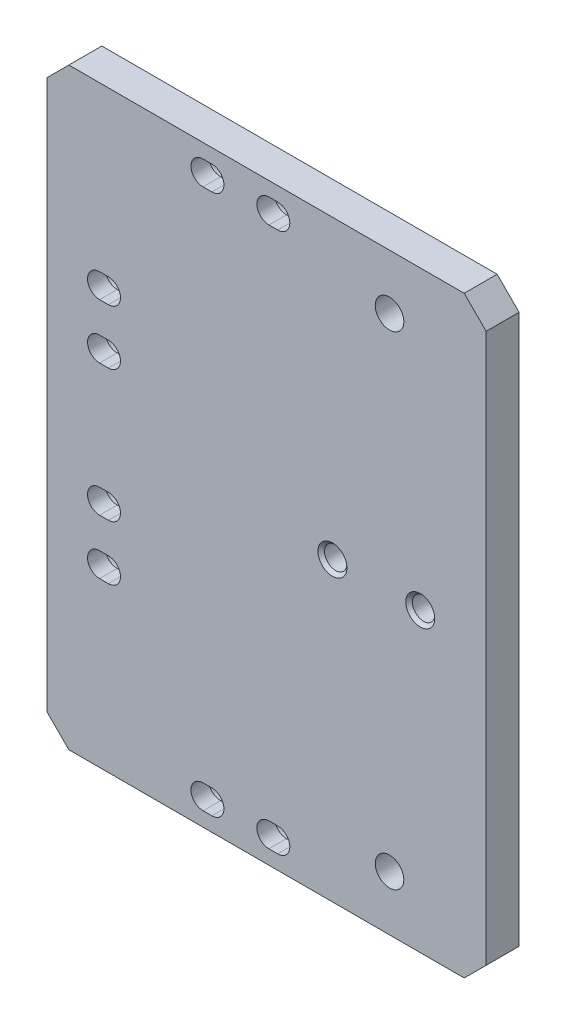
ISO-10303-21;
HEADER;
FILE_DESCRIPTION(('STEP AP214'),'2;1');
FILE_NAME('part.step','',(''),(''),'','','');
FILE_SCHEMA(('AUTOMOTIVE_DESIGN { 1 0 10303 214 1 1 1 1 }'));
ENDSEC;
DATA;
#1=APPLICATION_CONTEXT('core data for automotive mechanical design processes');
#2=APPLICATION_PROTOCOL_DEFINITION('international standard','automotive_design',2000,#1);
#3=PRODUCT_CONTEXT('',#1,'mechanical');
#4=PRODUCT('Part','Part','',(#3));
#5=PRODUCT_RELATED_PRODUCT_CATEGORY('part','',(#4));
#6=PRODUCT_DEFINITION_FORMATION('','',#4);
#7=PRODUCT_DEFINITION_CONTEXT('part definition',#1,'design');
#8=PRODUCT_DEFINITION('design','',#6,#7);
#9=PRODUCT_DEFINITION_SHAPE('','',#8);
#10=(LENGTH_UNIT() NAMED_UNIT(*) SI_UNIT(.MILLI.,.METRE.));
#11=(NAMED_UNIT(*) PLANE_ANGLE_UNIT() SI_UNIT($,.RADIAN.));
#12=(NAMED_UNIT(*) SI_UNIT($,.STERADIAN.) SOLID_ANGLE_UNIT());
#13=UNCERTAINTY_MEASURE_WITH_UNIT(LENGTH_MEASURE(1.E-05),#10,'distance_accuracy_value','');
#14=(GEOMETRIC_REPRESENTATION_CONTEXT(3) GLOBAL_UNCERTAINTY_ASSIGNED_CONTEXT((#13)) GLOBAL_UNIT_ASSIGNED_CONTEXT((#10,
#11,#12)) REPRESENTATION_CONTEXT('',''));
#15=CARTESIAN_POINT('',(0.,0.,0.));
#16=DIRECTION('',(0.,0.,1.));
#17=DIRECTION('',(1.,0.,0.));
#18=AXIS2_PLACEMENT_3D('',#15,#16,#17);
#19=CARTESIAN_POINT('',(0.,270.,15.));
#20=DIRECTION('',(1.,0.,0.));
#21=DIRECTION('',(0.,1.,0.));
#22=AXIS2_PLACEMENT_3D('',#19,#20,#21);
#23=PLANE('',#22);
#24=DIRECTION('',(0.,-1.,0.));
#25=VECTOR('',#24,1.);
#26=CARTESIAN_POINT('',(0.,270.,0.));
#27=LINE('',#26,#25);
#28=CARTESIAN_POINT('',(0.,260.,0.));
#29=VERTEX_POINT('',#28);
#30=CARTESIAN_POINT('',(0.,10.0000000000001,0.));
#31=VERTEX_POINT('',#30);
#32=EDGE_CURVE('E1146',#29,#31,#27,.T.);
#33=ORIENTED_EDGE('',*,*,#32,.T.);
#34=DIRECTION('',(0.,0.,1.));
#35=VECTOR('',#34,1.);
#36=CARTESIAN_POINT('',(0.,10.0000000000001,15.));
#37=LINE('',#36,#35);
#38=CARTESIAN_POINT('',(0.,10.0000000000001,15.));
#39=VERTEX_POINT('',#38);
#40=EDGE_CURVE('E1219',#31,#39,#37,.T.);
#41=ORIENTED_EDGE('',*,*,#40,.T.);
#42=DIRECTION('',(0.,-1.,0.));
#43=VECTOR('',#42,1.);
#44=CARTESIAN_POINT('',(0.,270.,15.));
#45=LINE('',#44,#43);
#46=CARTESIAN_POINT('',(0.,260.,15.));
#47=VERTEX_POINT('',#46);
#48=EDGE_CURVE('E1150',#47,#39,#45,.T.);
#49=ORIENTED_EDGE('',*,*,#48,.F.);
#50=DIRECTION('',(0.,0.,-1.));
#51=VECTOR('',#50,1.);
#52=CARTESIAN_POINT('',(0.,260.,15.));
#53=LINE('',#52,#51);
#54=EDGE_CURVE('E1215',#47,#29,#53,.T.);
#55=ORIENTED_EDGE('',*,*,#54,.T.);
#56=EDGE_LOOP('',(#33,#41,#49,#55));
#57=FACE_BOUND('',#56,.T.);
#58=ADVANCED_FACE('F44',(#57),#23,.F.);
#59=CARTESIAN_POINT('',(0.,0.,15.));
#60=DIRECTION('',(0.,1.,0.));
#61=DIRECTION('',(0.,0.,1.));
#62=AXIS2_PLACEMENT_3D('',#59,#60,#61);
#63=PLANE('',#62);
#64=DIRECTION('',(1.,0.,0.));
#65=VECTOR('',#64,1.);
#66=CARTESIAN_POINT('',(0.,0.,15.));
#67=LINE('',#66,#65);
#68=CARTESIAN_POINT('',(10.,0.,15.));
#69=VERTEX_POINT('',#68);
#70=CARTESIAN_POINT('',(190.,0.,15.));
#71=VERTEX_POINT('',#70);
#72=EDGE_CURVE('E1154',#69,#71,#67,.T.);
#73=ORIENTED_EDGE('',*,*,#72,.F.);
#74=DIRECTION('',(0.,0.,-1.));
#75=VECTOR('',#74,1.);
#76=CARTESIAN_POINT('',(10.,0.,15.));
#77=LINE('',#76,#75);
#78=CARTESIAN_POINT('',(10.,0.,0.));
#79=VERTEX_POINT('',#78);
#80=EDGE_CURVE('E1205',#69,#79,#77,.T.);
#81=ORIENTED_EDGE('',*,*,#80,.T.);
#82=DIRECTION('',(1.,0.,0.));
#83=VECTOR('',#82,1.);
#84=CARTESIAN_POINT('',(0.,0.,0.));
#85=LINE('',#84,#83);
#86=CARTESIAN_POINT('',(190.,0.,0.));
#87=VERTEX_POINT('',#86);
#88=EDGE_CURVE('E1175',#79,#87,#85,.T.);
#89=ORIENTED_EDGE('',*,*,#88,.T.);
#90=DIRECTION('',(0.,0.,-1.));
#91=VECTOR('',#90,1.);
#92=CARTESIAN_POINT('',(190.,0.,15.));
#93=LINE('',#92,#91);
#94=EDGE_CURVE('E1201',#71,#87,#93,.T.);
#95=ORIENTED_EDGE('',*,*,#94,.F.);
#96=EDGE_LOOP('',(#73,#81,#89,#95));
#97=FACE_BOUND('',#96,.T.);
#98=ADVANCED_FACE('F1352',(#97),#63,.F.);
#99=CARTESIAN_POINT('',(190.,0.,15.));
#100=DIRECTION('',(-0.707106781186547,0.707106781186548,0.));
#101=DIRECTION('',(-0.707106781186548,-0.707106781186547,0.));
#102=AXIS2_PLACEMENT_3D('',#99,#100,#101);
#103=PLANE('',#102);
#104=DIRECTION('',(0.707106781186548,0.707106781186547,0.));
#105=VECTOR('',#104,1.);
#106=CARTESIAN_POINT('',(190.,0.,0.));
#107=LINE('',#106,#105);
#108=CARTESIAN_POINT('',(200.,10.,0.));
#109=VERTEX_POINT('',#108);
#110=EDGE_CURVE('E1178',#87,#109,#107,.T.);
#111=ORIENTED_EDGE('',*,*,#110,.T.);
#112=DIRECTION('',(0.,0.,-1.));
#113=VECTOR('',#112,1.);
#114=CARTESIAN_POINT('',(200.,10.,15.));
#115=LINE('',#114,#113);
#116=CARTESIAN_POINT('',(200.,10.,15.));
#117=VERTEX_POINT('',#116);
#118=EDGE_CURVE('E1197',#117,#109,#115,.T.);
#119=ORIENTED_EDGE('',*,*,#118,.F.);
#120=DIRECTION('',(0.707106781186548,0.707106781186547,0.));
#121=VECTOR('',#120,1.);
#122=CARTESIAN_POINT('',(190.,0.,15.));
#123=LINE('',#122,#121);
#124=EDGE_CURVE('E1158',#71,#117,#123,.T.);
#125=ORIENTED_EDGE('',*,*,#124,.F.);
#126=ORIENTED_EDGE('',*,*,#94,.T.);
#127=EDGE_LOOP('',(#111,#119,#125,#126));
#128=FACE_BOUND('',#127,.T.);
#129=ADVANCED_FACE('F1358',(#128),#103,.F.);
#130=CARTESIAN_POINT('',(200.,260.,15.));
#131=DIRECTION('',(-1.,0.,0.));
#132=DIRECTION('',(0.,-1.,0.));
#133=AXIS2_PLACEMENT_3D('',#130,#131,#132);
#134=PLANE('',#133);
#135=DIRECTION('',(0.,1.,0.));
#136=VECTOR('',#135,1.);
#137=CARTESIAN_POINT('',(200.,260.,0.));
#138=LINE('',#137,#136);
#139=CARTESIAN_POINT('',(200.,260.,0.));
#140=VERTEX_POINT('',#139);
#141=EDGE_CURVE('E1181',#109,#140,#138,.T.);
#142=ORIENTED_EDGE('',*,*,#141,.T.);
#143=DIRECTION('',(0.,0.,-1.));
#144=VECTOR('',#143,1.);
#145=CARTESIAN_POINT('',(200.,260.,15.));
#146=LINE('',#145,#144);
#147=CARTESIAN_POINT('',(200.,260.,15.));
#148=VERTEX_POINT('',#147);
#149=EDGE_CURVE('E1193',#148,#140,#146,.T.);
#150=ORIENTED_EDGE('',*,*,#149,.F.);
#151=DIRECTION('',(0.,1.,0.));
#152=VECTOR('',#151,1.);
#153=CARTESIAN_POINT('',(200.,260.,15.));
#154=LINE('',#153,#152);
#155=EDGE_CURVE('E1161',#117,#148,#154,.T.);
#156=ORIENTED_EDGE('',*,*,#155,.F.);
#157=ORIENTED_EDGE('',*,*,#118,.T.);
#158=EDGE_LOOP('',(#142,#150,#156,#157));
#159=FACE_BOUND('',#158,.T.);
#160=ADVANCED_FACE('F1547',(#159),#134,.F.);
#161=CARTESIAN_POINT('',(190.,270.,15.));
#162=DIRECTION('',(-0.707106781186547,-0.707106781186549,0.));
#163=DIRECTION('',(0.707106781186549,-0.707106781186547,0.));
#164=AXIS2_PLACEMENT_3D('',#161,#162,#163);
#165=PLANE('',#164);
#166=DIRECTION('',(-0.707106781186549,0.707106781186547,0.));
#167=VECTOR('',#166,1.);
#168=CARTESIAN_POINT('',(190.,270.,0.));
#169=LINE('',#168,#167);
#170=CARTESIAN_POINT('',(190.,270.,0.));
#171=VERTEX_POINT('',#170);
#172=EDGE_CURVE('E1184',#140,#171,#169,.T.);
#173=ORIENTED_EDGE('',*,*,#172,.T.);
#174=DIRECTION('',(0.,0.,-1.));
#175=VECTOR('',#174,1.);
#176=CARTESIAN_POINT('',(190.,270.,15.));
#177=LINE('',#176,#175);
#178=CARTESIAN_POINT('',(190.,270.,15.));
#179=VERTEX_POINT('',#178);
#180=EDGE_CURVE('E1171',#179,#171,#177,.T.);
#181=ORIENTED_EDGE('',*,*,#180,.F.);
#182=DIRECTION('',(-0.707106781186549,0.707106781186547,0.));
#183=VECTOR('',#182,1.);
#184=CARTESIAN_POINT('',(190.,270.,15.));
#185=LINE('',#184,#183);
#186=EDGE_CURVE('E1164',#148,#179,#185,.T.);
#187=ORIENTED_EDGE('',*,*,#186,.F.);
#188=ORIENTED_EDGE('',*,*,#149,.T.);
#189=EDGE_LOOP('',(#173,#181,#187,#188));
#190=FACE_BOUND('',#189,.T.);
#191=ADVANCED_FACE('F1543',(#190),#165,.F.);
#192=CARTESIAN_POINT('',(190.,270.,15.));
#193=DIRECTION('',(0.,-1.,0.));
#194=DIRECTION('',(0.,0.,-1.));
#195=AXIS2_PLACEMENT_3D('',#192,#193,#194);
#196=PLANE('',#195);
#197=DIRECTION('',(-1.,0.,0.));
#198=VECTOR('',#197,1.);
#199=CARTESIAN_POINT('',(190.,270.,0.));
#200=LINE('',#199,#198);
#201=CARTESIAN_POINT('',(10.0000000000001,270.,0.));
#202=VERTEX_POINT('',#201);
#203=EDGE_CURVE('E1155',#171,#202,#200,.T.);
#204=ORIENTED_EDGE('',*,*,#203,.T.);
#205=DIRECTION('',(0.,0.,1.));
#206=VECTOR('',#205,1.);
#207=CARTESIAN_POINT('',(10.,270.,15.));
#208=LINE('',#207,#206);
#209=CARTESIAN_POINT('',(10.0000000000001,270.,15.));
#210=VERTEX_POINT('',#209);
#211=EDGE_CURVE('E1228',#202,#210,#208,.T.);
#212=ORIENTED_EDGE('',*,*,#211,.T.);
#213=DIRECTION('',(-1.,0.,0.));
#214=VECTOR('',#213,1.);
#215=CARTESIAN_POINT('',(190.,270.,15.));
#216=LINE('',#215,#214);
#217=EDGE_CURVE('E1167',#179,#210,#216,.T.);
#218=ORIENTED_EDGE('',*,*,#217,.F.);
#219=ORIENTED_EDGE('',*,*,#180,.T.);
#220=EDGE_LOOP('',(#204,#212,#218,#219));
#221=FACE_BOUND('',#220,.T.);
#222=ADVANCED_FACE('F1405',(#221),#196,.F.);
#223=CARTESIAN_POINT('',(0.,270.,15.));
#224=DIRECTION('',(0.,0.,-1.));
#225=DIRECTION('',(-1.,0.,0.));
#226=AXIS2_PLACEMENT_3D('',#223,#224,#225);
#227=PLANE('',#226);
#228=CARTESIAN_POINT('',(170.,135.,15.));
#229=DIRECTION('',(0.,0.,-1.));
#230=DIRECTION('',(-1.,0.,0.));
#231=AXIS2_PLACEMENT_3D('',#228,#229,#230);
#232=CIRCLE('',#231,6.60000000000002);
#233=CARTESIAN_POINT('',(163.4,135.,15.));
#234=VERTEX_POINT('',#233);
#235=EDGE_CURVE('E1251',#234,#234,#232,.T.);
#236=ORIENTED_EDGE('',*,*,#235,.T.);
#237=EDGE_LOOP('',(#236));
#238=FACE_BOUND('',#237,.T.);
#239=CARTESIAN_POINT('',(130.,135.,15.));
#240=DIRECTION('',(0.,0.,-1.));
#241=DIRECTION('',(-1.,0.,0.));
#242=AXIS2_PLACEMENT_3D('',#239,#240,#241);
#243=CIRCLE('',#242,6.60000000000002);
#244=CARTESIAN_POINT('',(123.4,135.,15.));
#245=VERTEX_POINT('',#244);
#246=EDGE_CURVE('E1247',#245,#245,#243,.T.);
#247=ORIENTED_EDGE('',*,*,#246,.T.);
#248=EDGE_LOOP('',(#247));
#249=FACE_BOUND('',#248,.T.);
#250=CARTESIAN_POINT('',(156.,25.,15.));
#251=DIRECTION('',(0.,0.,-1.));
#252=DIRECTION('',(1.,0.,0.));
#253=AXIS2_PLACEMENT_3D('',#250,#251,#252);
#254=CIRCLE('',#253,6.50000000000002);
#255=CARTESIAN_POINT('',(162.5,25.,15.));
#256=VERTEX_POINT('',#255);
#257=EDGE_CURVE('E1134',#256,#256,#254,.T.);
#258=ORIENTED_EDGE('',*,*,#257,.T.);
#259=EDGE_LOOP('',(#258));
#260=FACE_BOUND('',#259,.T.);
#261=CARTESIAN_POINT('',(156.,245.,15.));
#262=DIRECTION('',(0.,0.,-1.));
#263=DIRECTION('',(-1.,0.,0.));
#264=AXIS2_PLACEMENT_3D('',#261,#262,#263);
#265=CIRCLE('',#264,6.50000000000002);
#266=CARTESIAN_POINT('',(149.5,245.,15.));
#267=VERTEX_POINT('',#266);
#268=EDGE_CURVE('E1142',#267,#267,#265,.T.);
#269=ORIENTED_EDGE('',*,*,#268,.T.);
#270=EDGE_LOOP('',(#269));
#271=FACE_BOUND('',#270,.T.);
#272=CARTESIAN_POINT('',(24.,165.,15.));
#273=DIRECTION('',(0.,0.,-1.));
#274=DIRECTION('',(-1.,0.,0.));
#275=AXIS2_PLACEMENT_3D('',#272,#273,#274);
#276=CIRCLE('',#275,5.50000000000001);
#277=CARTESIAN_POINT('',(24.,159.5,15.));
#278=VERTEX_POINT('',#277);
#279=CARTESIAN_POINT('',(24.,170.5,15.));
#280=VERTEX_POINT('',#279);
#281=EDGE_CURVE('E913',#278,#280,#276,.T.);
#282=ORIENTED_EDGE('',*,*,#281,.T.);
#283=DIRECTION('',(1.,0.,0.));
#284=VECTOR('',#283,1.);
#285=CARTESIAN_POINT('',(28.,170.5,15.));
#286=LINE('',#285,#284);
#287=CARTESIAN_POINT('',(28.,170.5,15.));
#288=VERTEX_POINT('',#287);
#289=EDGE_CURVE('E917',#280,#288,#286,.T.);
#290=ORIENTED_EDGE('',*,*,#289,.T.);
#291=CARTESIAN_POINT('',(28.,165.,15.));
#292=DIRECTION('',(0.,0.,-1.));
#293=DIRECTION('',(-1.,0.,0.));
#294=AXIS2_PLACEMENT_3D('',#291,#292,#293);
#295=CIRCLE('',#294,5.50000000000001);
#296=CARTESIAN_POINT('',(28.,159.5,15.));
#297=VERTEX_POINT('',#296);
#298=EDGE_CURVE('E905',#288,#297,#295,.T.);
#299=ORIENTED_EDGE('',*,*,#298,.T.);
#300=DIRECTION('',(-1.,0.,0.));
#301=VECTOR('',#300,1.);
#302=CARTESIAN_POINT('',(28.,159.5,15.));
#303=LINE('',#302,#301);
#304=EDGE_CURVE('E909',#297,#278,#303,.T.);
#305=ORIENTED_EDGE('',*,*,#304,.T.);
#306=EDGE_LOOP('',(#282,#290,#299,#305));
#307=FACE_BOUND('',#306,.T.);
#308=CARTESIAN_POINT('',(24.,105.,15.));
#309=DIRECTION('',(0.,0.,-1.));
#310=DIRECTION('',(-1.,0.,0.));
#311=AXIS2_PLACEMENT_3D('',#308,#309,#310);
#312=CIRCLE('',#311,5.50000000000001);
#313=CARTESIAN_POINT('',(24.,99.5,15.));
#314=VERTEX_POINT('',#313);
#315=CARTESIAN_POINT('',(24.,110.5,15.));
#316=VERTEX_POINT('',#315);
#317=EDGE_CURVE('E875',#314,#316,#312,.T.);
#318=ORIENTED_EDGE('',*,*,#317,.T.);
#319=DIRECTION('',(1.,0.,0.));
#320=VECTOR('',#319,1.);
#321=CARTESIAN_POINT('',(28.,110.5,15.));
#322=LINE('',#321,#320);
#323=CARTESIAN_POINT('',(28.,110.5,15.));
#324=VERTEX_POINT('',#323);
#325=EDGE_CURVE('E879',#316,#324,#322,.T.);
#326=ORIENTED_EDGE('',*,*,#325,.T.);
#327=CARTESIAN_POINT('',(28.,105.,15.));
#328=DIRECTION('',(0.,0.,-1.));
#329=DIRECTION('',(-1.,0.,0.));
#330=AXIS2_PLACEMENT_3D('',#327,#328,#329);
#331=CIRCLE('',#330,5.50000000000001);
#332=CARTESIAN_POINT('',(28.,99.5,15.));
#333=VERTEX_POINT('',#332);
#334=EDGE_CURVE('E867',#324,#333,#331,.T.);
#335=ORIENTED_EDGE('',*,*,#334,.T.);
#336=DIRECTION('',(-1.,0.,0.));
#337=VECTOR('',#336,1.);
#338=CARTESIAN_POINT('',(28.,99.5,15.));
#339=LINE('',#338,#337);
#340=EDGE_CURVE('E871',#333,#314,#339,.T.);
#341=ORIENTED_EDGE('',*,*,#340,.T.);
#342=EDGE_LOOP('',(#318,#326,#335,#341));
#343=FACE_BOUND('',#342,.T.);
#344=CARTESIAN_POINT('',(24.,190.,15.));
#345=DIRECTION('',(0.,0.,-1.));
#346=DIRECTION('',(-1.,0.,0.));
#347=AXIS2_PLACEMENT_3D('',#344,#345,#346);
#348=CIRCLE('',#347,5.50000000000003);
#349=CARTESIAN_POINT('',(24.,184.5,15.));
#350=VERTEX_POINT('',#349);
#351=CARTESIAN_POINT('',(24.,195.5,15.));
#352=VERTEX_POINT('',#351);
#353=EDGE_CURVE('E951',#350,#352,#348,.T.);
#354=ORIENTED_EDGE('',*,*,#353,.T.);
#355=DIRECTION('',(1.,0.,0.));
#356=VECTOR('',#355,1.);
#357=CARTESIAN_POINT('',(28.,195.5,15.));
#358=LINE('',#357,#356);
#359=CARTESIAN_POINT('',(28.,195.5,15.));
#360=VERTEX_POINT('',#359);
#361=EDGE_CURVE('E955',#352,#360,#358,.T.);
#362=ORIENTED_EDGE('',*,*,#361,.T.);
#363=CARTESIAN_POINT('',(28.,190.,15.));
#364=DIRECTION('',(0.,0.,-1.));
#365=DIRECTION('',(-1.,0.,0.));
#366=AXIS2_PLACEMENT_3D('',#363,#364,#365);
#367=CIRCLE('',#366,5.50000000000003);
#368=CARTESIAN_POINT('',(28.,184.5,15.));
#369=VERTEX_POINT('',#368);
#370=EDGE_CURVE('E943',#360,#369,#367,.T.);
#371=ORIENTED_EDGE('',*,*,#370,.T.);
#372=DIRECTION('',(-1.,0.,0.));
#373=VECTOR('',#372,1.);
#374=CARTESIAN_POINT('',(28.,184.5,15.));
#375=LINE('',#374,#373);
#376=EDGE_CURVE('E947',#369,#350,#375,.T.);
#377=ORIENTED_EDGE('',*,*,#376,.T.);
#378=EDGE_LOOP('',(#354,#362,#371,#377));
#379=FACE_BOUND('',#378,.T.);
#380=CARTESIAN_POINT('',(24.,80.,15.));
#381=DIRECTION('',(0.,0.,-1.));
#382=DIRECTION('',(-1.,0.,0.));
#383=AXIS2_PLACEMENT_3D('',#380,#381,#382);
#384=CIRCLE('',#383,5.50000000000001);
#385=CARTESIAN_POINT('',(24.,74.5,15.));
#386=VERTEX_POINT('',#385);
#387=CARTESIAN_POINT('',(24.,85.5,15.));
#388=VERTEX_POINT('',#387);
#389=EDGE_CURVE('E837',#386,#388,#384,.T.);
#390=ORIENTED_EDGE('',*,*,#389,.T.);
#391=DIRECTION('',(1.,0.,0.));
#392=VECTOR('',#391,1.);
#393=CARTESIAN_POINT('',(28.,85.5,15.));
#394=LINE('',#393,#392);
#395=CARTESIAN_POINT('',(28.,85.5,15.));
#396=VERTEX_POINT('',#395);
#397=EDGE_CURVE('E841',#388,#396,#394,.T.);
#398=ORIENTED_EDGE('',*,*,#397,.T.);
#399=CARTESIAN_POINT('',(28.,80.,15.));
#400=DIRECTION('',(0.,0.,-1.));
#401=DIRECTION('',(-1.,0.,0.));
#402=AXIS2_PLACEMENT_3D('',#399,#400,#401);
#403=CIRCLE('',#402,5.50000000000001);
#404=CARTESIAN_POINT('',(28.,74.5,15.));
#405=VERTEX_POINT('',#404);
#406=EDGE_CURVE('E829',#396,#405,#403,.T.);
#407=ORIENTED_EDGE('',*,*,#406,.T.);
#408=DIRECTION('',(-1.,0.,0.));
#409=VECTOR('',#408,1.);
#410=CARTESIAN_POINT('',(28.,74.5,15.));
#411=LINE('',#410,#409);
#412=EDGE_CURVE('E833',#405,#386,#411,.T.);
#413=ORIENTED_EDGE('',*,*,#412,.T.);
#414=EDGE_LOOP('',(#390,#398,#407,#413));
#415=FACE_BOUND('',#414,.T.);
#416=CARTESIAN_POINT('',(71.1,258.,15.));
#417=DIRECTION('',(0.,0.,-1.));
#418=DIRECTION('',(1.,0.,0.));
#419=AXIS2_PLACEMENT_3D('',#416,#417,#418);
#420=CIRCLE('',#419,5.50000000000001);
#421=CARTESIAN_POINT('',(71.1,252.5,15.));
#422=VERTEX_POINT('',#421);
#423=CARTESIAN_POINT('',(71.1,263.5,15.));
#424=VERTEX_POINT('',#423);
#425=EDGE_CURVE('E1065',#422,#424,#420,.T.);
#426=ORIENTED_EDGE('',*,*,#425,.T.);
#427=DIRECTION('',(1.,0.,0.));
#428=VECTOR('',#427,1.);
#429=CARTESIAN_POINT('',(71.1,263.5,15.));
#430=LINE('',#429,#428);
#431=CARTESIAN_POINT('',(75.1,263.5,15.));
#432=VERTEX_POINT('',#431);
#433=EDGE_CURVE('E1069',#424,#432,#430,.T.);
#434=ORIENTED_EDGE('',*,*,#433,.T.);
#435=CARTESIAN_POINT('',(75.1,258.,15.));
#436=DIRECTION('',(0.,0.,-1.));
#437=DIRECTION('',(-1.,0.,0.));
#438=AXIS2_PLACEMENT_3D('',#435,#436,#437);
#439=CIRCLE('',#438,5.50000000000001);
#440=CARTESIAN_POINT('',(75.1,252.5,15.));
#441=VERTEX_POINT('',#440);
#442=EDGE_CURVE('E1057',#432,#441,#439,.T.);
#443=ORIENTED_EDGE('',*,*,#442,.T.);
#444=DIRECTION('',(-1.,0.,0.));
#445=VECTOR('',#444,1.);
#446=CARTESIAN_POINT('',(71.1,252.5,15.));
#447=LINE('',#446,#445);
#448=EDGE_CURVE('E1061',#441,#422,#447,.T.);
#449=ORIENTED_EDGE('',*,*,#448,.T.);
#450=EDGE_LOOP('',(#426,#434,#443,#449));
#451=FACE_BOUND('',#450,.T.);
#452=CARTESIAN_POINT('',(101.1,258.,15.));
#453=DIRECTION('',(0.,0.,-1.));
#454=DIRECTION('',(1.,0.,0.));
#455=AXIS2_PLACEMENT_3D('',#452,#453,#454);
#456=CIRCLE('',#455,5.50000000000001);
#457=CARTESIAN_POINT('',(101.1,252.5,15.));
#458=VERTEX_POINT('',#457);
#459=CARTESIAN_POINT('',(101.1,263.5,15.));
#460=VERTEX_POINT('',#459);
#461=EDGE_CURVE('E1103',#458,#460,#456,.T.);
#462=ORIENTED_EDGE('',*,*,#461,.T.);
#463=DIRECTION('',(1.,0.,0.));
#464=VECTOR('',#463,1.);
#465=CARTESIAN_POINT('',(101.1,263.5,15.));
#466=LINE('',#465,#464);
#467=CARTESIAN_POINT('',(105.1,263.5,15.));
#468=VERTEX_POINT('',#467);
#469=EDGE_CURVE('E1107',#460,#468,#466,.T.);
#470=ORIENTED_EDGE('',*,*,#469,.T.);
#471=CARTESIAN_POINT('',(105.1,258.,15.));
#472=DIRECTION('',(0.,0.,-1.));
#473=DIRECTION('',(-1.,0.,0.));
#474=AXIS2_PLACEMENT_3D('',#471,#472,#473);
#475=CIRCLE('',#474,5.50000000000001);
#476=CARTESIAN_POINT('',(105.1,252.5,15.));
#477=VERTEX_POINT('',#476);
#478=EDGE_CURVE('E1095',#468,#477,#475,.T.);
#479=ORIENTED_EDGE('',*,*,#478,.T.);
#480=DIRECTION('',(-1.,0.,0.));
#481=VECTOR('',#480,1.);
#482=CARTESIAN_POINT('',(101.1,252.5,15.));
#483=LINE('',#482,#481);
#484=EDGE_CURVE('E1099',#477,#458,#483,.T.);
#485=ORIENTED_EDGE('',*,*,#484,.T.);
#486=EDGE_LOOP('',(#462,#470,#479,#485));
#487=FACE_BOUND('',#486,.T.);
#488=CARTESIAN_POINT('',(101.1,12.,15.));
#489=DIRECTION('',(0.,0.,-1.));
#490=DIRECTION('',(-1.,0.,0.));
#491=AXIS2_PLACEMENT_3D('',#488,#489,#490);
#492=CIRCLE('',#491,5.50000000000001);
#493=CARTESIAN_POINT('',(101.1,6.49999999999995,15.));
#494=VERTEX_POINT('',#493);
#495=CARTESIAN_POINT('',(101.1,17.5,15.));
#496=VERTEX_POINT('',#495);
#497=EDGE_CURVE('E989',#494,#496,#492,.T.);
#498=ORIENTED_EDGE('',*,*,#497,.T.);
#499=DIRECTION('',(1.,0.,0.));
#500=VECTOR('',#499,1.);
#501=CARTESIAN_POINT('',(101.1,17.5,15.));
#502=LINE('',#501,#500);
#503=CARTESIAN_POINT('',(105.1,17.5,15.));
#504=VERTEX_POINT('',#503);
#505=EDGE_CURVE('E993',#496,#504,#502,.T.);
#506=ORIENTED_EDGE('',*,*,#505,.T.);
#507=CARTESIAN_POINT('',(105.1,12.,15.));
#508=DIRECTION('',(0.,0.,-1.));
#509=DIRECTION('',(1.,0.,0.));
#510=AXIS2_PLACEMENT_3D('',#507,#508,#509);
#511=CIRCLE('',#510,5.50000000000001);
#512=CARTESIAN_POINT('',(105.1,6.49999999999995,15.));
#513=VERTEX_POINT('',#512);
#514=EDGE_CURVE('E981',#504,#513,#511,.T.);
#515=ORIENTED_EDGE('',*,*,#514,.T.);
#516=DIRECTION('',(-1.,0.,0.));
#517=VECTOR('',#516,1.);
#518=CARTESIAN_POINT('',(101.1,6.49999999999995,15.));
#519=LINE('',#518,#517);
#520=EDGE_CURVE('E985',#513,#494,#519,.T.);
#521=ORIENTED_EDGE('',*,*,#520,.T.);
#522=EDGE_LOOP('',(#498,#506,#515,#521));
#523=FACE_BOUND('',#522,.T.);
#524=CARTESIAN_POINT('',(71.1,12.,15.));
#525=DIRECTION('',(0.,0.,-1.));
#526=DIRECTION('',(-1.,0.,0.));
#527=AXIS2_PLACEMENT_3D('',#524,#525,#526);
#528=CIRCLE('',#527,5.50000000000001);
#529=CARTESIAN_POINT('',(71.1,6.49999999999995,15.));
#530=VERTEX_POINT('',#529);
#531=CARTESIAN_POINT('',(71.1,17.5,15.));
#532=VERTEX_POINT('',#531);
#533=EDGE_CURVE('E1027',#530,#532,#528,.T.);
#534=ORIENTED_EDGE('',*,*,#533,.T.);
#535=DIRECTION('',(1.,0.,0.));
#536=VECTOR('',#535,1.);
#537=CARTESIAN_POINT('',(71.1,17.5,15.));
#538=LINE('',#537,#536);
#539=CARTESIAN_POINT('',(75.1,17.5,15.));
#540=VERTEX_POINT('',#539);
#541=EDGE_CURVE('E1031',#532,#540,#538,.T.);
#542=ORIENTED_EDGE('',*,*,#541,.T.);
#543=CARTESIAN_POINT('',(75.1,12.,15.));
#544=DIRECTION('',(0.,0.,-1.));
#545=DIRECTION('',(1.,0.,0.));
#546=AXIS2_PLACEMENT_3D('',#543,#544,#545);
#547=CIRCLE('',#546,5.50000000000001);
#548=CARTESIAN_POINT('',(75.1,6.49999999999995,15.));
#549=VERTEX_POINT('',#548);
#550=EDGE_CURVE('E1019',#540,#549,#547,.T.);
#551=ORIENTED_EDGE('',*,*,#550,.T.);
#552=DIRECTION('',(-1.,0.,0.));
#553=VECTOR('',#552,1.);
#554=CARTESIAN_POINT('',(71.1,6.49999999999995,15.));
#555=LINE('',#554,#553);
#556=EDGE_CURVE('E1023',#549,#530,#555,.T.);
#557=ORIENTED_EDGE('',*,*,#556,.T.);
#558=EDGE_LOOP('',(#534,#542,#551,#557));
#559=FACE_BOUND('',#558,.T.);
#560=ORIENTED_EDGE('',*,*,#48,.T.);
#561=DIRECTION('',(-0.707106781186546,0.707106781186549,0.));
#562=VECTOR('',#561,1.);
#563=CARTESIAN_POINT('',(10.,0.,15.));
#564=LINE('',#563,#562);
#565=EDGE_CURVE('E1225',#39,#69,#564,.F.);
#566=ORIENTED_EDGE('',*,*,#565,.T.);
#567=ORIENTED_EDGE('',*,*,#72,.T.);
#568=ORIENTED_EDGE('',*,*,#124,.T.);
#569=ORIENTED_EDGE('',*,*,#155,.T.);
#570=ORIENTED_EDGE('',*,*,#186,.T.);
#571=ORIENTED_EDGE('',*,*,#217,.T.);
#572=DIRECTION('',(0.707106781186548,0.707106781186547,0.));
#573=VECTOR('',#572,1.);
#574=CARTESIAN_POINT('',(0.,260.,15.));
#575=LINE('',#574,#573);
#576=EDGE_CURVE('E1222',#210,#47,#575,.F.);
#577=ORIENTED_EDGE('',*,*,#576,.T.);
#578=EDGE_LOOP('',(#560,#566,#567,#568,#569,#570,#571,#577));
#579=FACE_BOUND('',#578,.T.);
#580=ADVANCED_FACE('F1330',(#238,#249,#260,#271,#307,#343,#379,#415,#451,#487,#523,#559,#579),
#227,.F.);
#581=CARTESIAN_POINT('',(0.,270.,0.));
#582=DIRECTION('',(0.,0.,-1.));
#583=DIRECTION('',(-1.,0.,0.));
#584=AXIS2_PLACEMENT_3D('',#581,#582,#583);
#585=PLANE('',#584);
#586=DIRECTION('',(-1.,0.,0.));
#587=VECTOR('',#586,1.);
#588=CARTESIAN_POINT('',(28.,71.5,0.));
#589=LINE('',#588,#587);
#590=CARTESIAN_POINT('',(28.,71.5,0.));
#591=VERTEX_POINT('',#590);
#592=CARTESIAN_POINT('',(24.,71.5,0.));
#593=VERTEX_POINT('',#592);
#594=EDGE_CURVE('E522',#591,#593,#589,.T.);
#595=ORIENTED_EDGE('',*,*,#594,.F.);
#596=CARTESIAN_POINT('',(28.,80.,0.));
#597=DIRECTION('',(0.,0.,-1.));
#598=DIRECTION('',(-1.,0.,0.));
#599=AXIS2_PLACEMENT_3D('',#596,#597,#598);
#600=CIRCLE('',#599,8.49999999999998);
#601=CARTESIAN_POINT('',(28.,88.5,0.));
#602=VERTEX_POINT('',#601);
#603=EDGE_CURVE('E2265',#602,#591,#600,.T.);
#604=ORIENTED_EDGE('',*,*,#603,.F.);
#605=DIRECTION('',(1.,0.,0.));
#606=VECTOR('',#605,1.);
#607=CARTESIAN_POINT('',(28.,88.5,0.));
#608=LINE('',#607,#606);
#609=CARTESIAN_POINT('',(24.,88.5,0.));
#610=VERTEX_POINT('',#609);
#611=EDGE_CURVE('E508',#610,#602,#608,.T.);
#612=ORIENTED_EDGE('',*,*,#611,.F.);
#613=CARTESIAN_POINT('',(24.,80.,0.));
#614=DIRECTION('',(0.,0.,-1.));
#615=DIRECTION('',(-1.,0.,0.));
#616=AXIS2_PLACEMENT_3D('',#613,#614,#615);
#617=CIRCLE('',#616,8.49999999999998);
#618=EDGE_CURVE('E2263',#593,#610,#617,.T.);
#619=ORIENTED_EDGE('',*,*,#618,.F.);
#620=EDGE_LOOP('',(#595,#604,#612,#619));
#621=FACE_BOUND('',#620,.T.);
#622=DIRECTION('',(-1.,0.,0.));
#623=VECTOR('',#622,1.);
#624=CARTESIAN_POINT('',(28.,96.5,0.));
#625=LINE('',#624,#623);
#626=CARTESIAN_POINT('',(28.,96.5,0.));
#627=VERTEX_POINT('',#626);
#628=CARTESIAN_POINT('',(24.,96.5,0.));
#629=VERTEX_POINT('',#628);
#630=EDGE_CURVE('E540',#627,#629,#625,.T.);
#631=ORIENTED_EDGE('',*,*,#630,.F.);
#632=CARTESIAN_POINT('',(28.,105.,0.));
#633=DIRECTION('',(0.,0.,-1.));
#634=DIRECTION('',(-1.,0.,0.));
#635=AXIS2_PLACEMENT_3D('',#632,#633,#634);
#636=CIRCLE('',#635,8.49999999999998);
#637=CARTESIAN_POINT('',(28.,113.5,0.));
#638=VERTEX_POINT('',#637);
#639=EDGE_CURVE('E531',#638,#627,#636,.T.);
#640=ORIENTED_EDGE('',*,*,#639,.F.);
#641=DIRECTION('',(1.,0.,0.));
#642=VECTOR('',#641,1.);
#643=CARTESIAN_POINT('',(28.,113.5,0.));
#644=LINE('',#643,#642);
#645=CARTESIAN_POINT('',(24.,113.5,0.));
#646=VERTEX_POINT('',#645);
#647=EDGE_CURVE('E532',#646,#638,#644,.T.);
#648=ORIENTED_EDGE('',*,*,#647,.F.);
#649=CARTESIAN_POINT('',(24.,105.,0.));
#650=DIRECTION('',(0.,0.,-1.));
#651=DIRECTION('',(-1.,0.,0.));
#652=AXIS2_PLACEMENT_3D('',#649,#650,#651);
#653=CIRCLE('',#652,8.49999999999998);
#654=EDGE_CURVE('E536',#629,#646,#653,.T.);
#655=ORIENTED_EDGE('',*,*,#654,.F.);
#656=EDGE_LOOP('',(#631,#640,#648,#655));
#657=FACE_BOUND('',#656,.T.);
#658=DIRECTION('',(-1.,0.,0.));
#659=VECTOR('',#658,1.);
#660=CARTESIAN_POINT('',(28.,156.5,0.));
#661=LINE('',#660,#659);
#662=CARTESIAN_POINT('',(28.,156.5,0.));
#663=VERTEX_POINT('',#662);
#664=CARTESIAN_POINT('',(24.,156.5,0.));
#665=VERTEX_POINT('',#664);
#666=EDGE_CURVE('E581',#663,#665,#661,.T.);
#667=ORIENTED_EDGE('',*,*,#666,.F.);
#668=CARTESIAN_POINT('',(28.,165.,0.));
#669=DIRECTION('',(0.,0.,-1.));
#670=DIRECTION('',(-1.,0.,0.));
#671=AXIS2_PLACEMENT_3D('',#668,#669,#670);
#672=CIRCLE('',#671,8.50000000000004);
#673=CARTESIAN_POINT('',(28.,173.5,0.));
#674=VERTEX_POINT('',#673);
#675=EDGE_CURVE('E571',#674,#663,#672,.T.);
#676=ORIENTED_EDGE('',*,*,#675,.F.);
#677=DIRECTION('',(1.,0.,0.));
#678=VECTOR('',#677,1.);
#679=CARTESIAN_POINT('',(28.,173.5,0.));
#680=LINE('',#679,#678);
#681=CARTESIAN_POINT('',(24.,173.5,0.));
#682=VERTEX_POINT('',#681);
#683=EDGE_CURVE('E572',#682,#674,#680,.T.);
#684=ORIENTED_EDGE('',*,*,#683,.F.);
#685=CARTESIAN_POINT('',(24.,165.,0.));
#686=DIRECTION('',(0.,0.,-1.));
#687=DIRECTION('',(-1.,0.,0.));
#688=AXIS2_PLACEMENT_3D('',#685,#686,#687);
#689=CIRCLE('',#688,8.50000000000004);
#690=EDGE_CURVE('E577',#665,#682,#689,.T.);
#691=ORIENTED_EDGE('',*,*,#690,.F.);
#692=EDGE_LOOP('',(#667,#676,#684,#691));
#693=FACE_BOUND('',#692,.T.);
#694=DIRECTION('',(-1.,0.,0.));
#695=VECTOR('',#694,1.);
#696=CARTESIAN_POINT('',(28.,181.5,0.));
#697=LINE('',#696,#695);
#698=CARTESIAN_POINT('',(28.,181.5,0.));
#699=VERTEX_POINT('',#698);
#700=CARTESIAN_POINT('',(24.,181.5,0.));
#701=VERTEX_POINT('',#700);
#702=EDGE_CURVE('E624',#699,#701,#697,.T.);
#703=ORIENTED_EDGE('',*,*,#702,.F.);
#704=CARTESIAN_POINT('',(28.,190.,0.));
#705=DIRECTION('',(0.,0.,-1.));
#706=DIRECTION('',(-1.,0.,0.));
#707=AXIS2_PLACEMENT_3D('',#704,#705,#706);
#708=CIRCLE('',#707,8.50000000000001);
#709=CARTESIAN_POINT('',(28.,198.5,0.));
#710=VERTEX_POINT('',#709);
#711=EDGE_CURVE('E614',#710,#699,#708,.T.);
#712=ORIENTED_EDGE('',*,*,#711,.F.);
#713=DIRECTION('',(1.,0.,0.));
#714=VECTOR('',#713,1.);
#715=CARTESIAN_POINT('',(28.,198.5,0.));
#716=LINE('',#715,#714);
#717=CARTESIAN_POINT('',(24.,198.5,0.));
#718=VERTEX_POINT('',#717);
#719=EDGE_CURVE('E615',#718,#710,#716,.T.);
#720=ORIENTED_EDGE('',*,*,#719,.F.);
#721=CARTESIAN_POINT('',(24.,190.,0.));
#722=DIRECTION('',(0.,0.,-1.));
#723=DIRECTION('',(-1.,0.,0.));
#724=AXIS2_PLACEMENT_3D('',#721,#722,#723);
#725=CIRCLE('',#724,8.50000000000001);
#726=EDGE_CURVE('E620',#701,#718,#725,.T.);
#727=ORIENTED_EDGE('',*,*,#726,.F.);
#728=EDGE_LOOP('',(#703,#712,#720,#727));
#729=FACE_BOUND('',#728,.T.);
#730=DIRECTION('',(-1.,0.,0.));
#731=VECTOR('',#730,1.);
#732=CARTESIAN_POINT('',(101.1,3.49999999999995,0.));
#733=LINE('',#732,#731);
#734=CARTESIAN_POINT('',(105.1,3.49999999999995,0.));
#735=VERTEX_POINT('',#734);
#736=CARTESIAN_POINT('',(101.1,3.49999999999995,0.));
#737=VERTEX_POINT('',#736);
#738=EDGE_CURVE('E666',#735,#737,#733,.T.);
#739=ORIENTED_EDGE('',*,*,#738,.F.);
#740=CARTESIAN_POINT('',(105.1,12.,0.));
#741=DIRECTION('',(0.,0.,-1.));
#742=DIRECTION('',(1.,0.,0.));
#743=AXIS2_PLACEMENT_3D('',#740,#741,#742);
#744=CIRCLE('',#743,8.50000000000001);
#745=CARTESIAN_POINT('',(105.1,20.5,0.));
#746=VERTEX_POINT('',#745);
#747=EDGE_CURVE('E657',#746,#735,#744,.T.);
#748=ORIENTED_EDGE('',*,*,#747,.F.);
#749=DIRECTION('',(1.,0.,0.));
#750=VECTOR('',#749,1.);
#751=CARTESIAN_POINT('',(101.1,20.5,0.));
#752=LINE('',#751,#750);
#753=CARTESIAN_POINT('',(101.1,20.5,0.));
#754=VERTEX_POINT('',#753);
#755=EDGE_CURVE('E658',#754,#746,#752,.T.);
#756=ORIENTED_EDGE('',*,*,#755,.F.);
#757=CARTESIAN_POINT('',(101.1,12.,0.));
#758=DIRECTION('',(0.,0.,-1.));
#759=DIRECTION('',(-1.,0.,0.));
#760=AXIS2_PLACEMENT_3D('',#757,#758,#759);
#761=CIRCLE('',#760,8.50000000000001);
#762=EDGE_CURVE('E662',#737,#754,#761,.T.);
#763=ORIENTED_EDGE('',*,*,#762,.F.);
#764=EDGE_LOOP('',(#739,#748,#756,#763));
#765=FACE_BOUND('',#764,.T.);
#766=DIRECTION('',(-1.,0.,0.));
#767=VECTOR('',#766,1.);
#768=CARTESIAN_POINT('',(71.1,3.49999999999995,0.));
#769=LINE('',#768,#767);
#770=CARTESIAN_POINT('',(75.1,3.49999999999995,0.));
#771=VERTEX_POINT('',#770);
#772=CARTESIAN_POINT('',(71.1,3.49999999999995,0.));
#773=VERTEX_POINT('',#772);
#774=EDGE_CURVE('E709',#771,#773,#769,.T.);
#775=ORIENTED_EDGE('',*,*,#774,.F.);
#776=CARTESIAN_POINT('',(75.1,11.9999999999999,0.));
#777=DIRECTION('',(0.,0.,-1.));
#778=DIRECTION('',(1.,0.,0.));
#779=AXIS2_PLACEMENT_3D('',#776,#777,#778);
#780=CIRCLE('',#779,8.50000000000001);
#781=CARTESIAN_POINT('',(75.1,20.4999999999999,0.));
#782=VERTEX_POINT('',#781);
#783=EDGE_CURVE('E700',#782,#771,#780,.T.);
#784=ORIENTED_EDGE('',*,*,#783,.F.);
#785=DIRECTION('',(1.,0.,0.));
#786=VECTOR('',#785,1.);
#787=CARTESIAN_POINT('',(71.1,20.5,0.));
#788=LINE('',#787,#786);
#789=CARTESIAN_POINT('',(71.1,20.4999999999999,0.));
#790=VERTEX_POINT('',#789);
#791=EDGE_CURVE('E701',#790,#782,#788,.T.);
#792=ORIENTED_EDGE('',*,*,#791,.F.);
#793=CARTESIAN_POINT('',(71.1,11.9999999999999,0.));
#794=DIRECTION('',(0.,0.,-1.));
#795=DIRECTION('',(-1.,0.,0.));
#796=AXIS2_PLACEMENT_3D('',#793,#794,#795);
#797=CIRCLE('',#796,8.50000000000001);
#798=EDGE_CURVE('E705',#773,#790,#797,.T.);
#799=ORIENTED_EDGE('',*,*,#798,.F.);
#800=EDGE_LOOP('',(#775,#784,#792,#799));
#801=FACE_BOUND('',#800,.T.);
#802=DIRECTION('',(-1.,0.,0.));
#803=VECTOR('',#802,1.);
#804=CARTESIAN_POINT('',(101.1,249.5,0.));
#805=LINE('',#804,#803);
#806=CARTESIAN_POINT('',(105.1,249.5,0.));
#807=VERTEX_POINT('',#806);
#808=CARTESIAN_POINT('',(101.1,249.5,0.));
#809=VERTEX_POINT('',#808);
#810=EDGE_CURVE('E753',#807,#809,#805,.T.);
#811=ORIENTED_EDGE('',*,*,#810,.F.);
#812=CARTESIAN_POINT('',(105.1,258.,0.));
#813=DIRECTION('',(0.,0.,-1.));
#814=DIRECTION('',(-1.,0.,0.));
#815=AXIS2_PLACEMENT_3D('',#812,#813,#814);
#816=CIRCLE('',#815,8.50000000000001);
#817=CARTESIAN_POINT('',(105.1,266.5,0.));
#818=VERTEX_POINT('',#817);
#819=EDGE_CURVE('E743',#818,#807,#816,.T.);
#820=ORIENTED_EDGE('',*,*,#819,.F.);
#821=DIRECTION('',(1.,0.,0.));
#822=VECTOR('',#821,1.);
#823=CARTESIAN_POINT('',(101.1,266.5,0.));
#824=LINE('',#823,#822);
#825=CARTESIAN_POINT('',(101.1,266.5,0.));
#826=VERTEX_POINT('',#825);
#827=EDGE_CURVE('E744',#826,#818,#824,.T.);
#828=ORIENTED_EDGE('',*,*,#827,.F.);
#829=CARTESIAN_POINT('',(101.1,258.,0.));
#830=DIRECTION('',(0.,0.,-1.));
#831=DIRECTION('',(1.,0.,0.));
#832=AXIS2_PLACEMENT_3D('',#829,#830,#831);
#833=CIRCLE('',#832,8.50000000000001);
#834=EDGE_CURVE('E749',#809,#826,#833,.T.);
#835=ORIENTED_EDGE('',*,*,#834,.F.);
#836=EDGE_LOOP('',(#811,#820,#828,#835));
#837=FACE_BOUND('',#836,.T.);
#838=DIRECTION('',(-1.,0.,0.));
#839=VECTOR('',#838,1.);
#840=CARTESIAN_POINT('',(71.1,249.5,0.));
#841=LINE('',#840,#839);
#842=CARTESIAN_POINT('',(75.1,249.5,0.));
#843=VERTEX_POINT('',#842);
#844=CARTESIAN_POINT('',(71.1,249.5,0.));
#845=VERTEX_POINT('',#844);
#846=EDGE_CURVE('E796',#843,#845,#841,.T.);
#847=ORIENTED_EDGE('',*,*,#846,.F.);
#848=CARTESIAN_POINT('',(75.1,258.,0.));
#849=DIRECTION('',(0.,0.,-1.));
#850=DIRECTION('',(-1.,0.,0.));
#851=AXIS2_PLACEMENT_3D('',#848,#849,#850);
#852=CIRCLE('',#851,8.50000000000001);
#853=CARTESIAN_POINT('',(75.1,266.5,0.));
#854=VERTEX_POINT('',#853);
#855=EDGE_CURVE('E786',#854,#843,#852,.T.);
#856=ORIENTED_EDGE('',*,*,#855,.F.);
#857=DIRECTION('',(1.,0.,0.));
#858=VECTOR('',#857,1.);
#859=CARTESIAN_POINT('',(71.1,266.5,0.));
#860=LINE('',#859,#858);
#861=CARTESIAN_POINT('',(71.1,266.5,0.));
#862=VERTEX_POINT('',#861);
#863=EDGE_CURVE('E787',#862,#854,#860,.T.);
#864=ORIENTED_EDGE('',*,*,#863,.F.);
#865=CARTESIAN_POINT('',(71.1,258.,0.));
#866=DIRECTION('',(0.,0.,-1.));
#867=DIRECTION('',(1.,0.,0.));
#868=AXIS2_PLACEMENT_3D('',#865,#866,#867);
#869=CIRCLE('',#868,8.50000000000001);
#870=EDGE_CURVE('E792',#845,#862,#869,.T.);
#871=ORIENTED_EDGE('',*,*,#870,.F.);
#872=EDGE_LOOP('',(#847,#856,#864,#871));
#873=FACE_BOUND('',#872,.T.);
#874=CARTESIAN_POINT('',(170.,135.,0.));
#875=DIRECTION('',(0.,0.,-1.));
#876=DIRECTION('',(-1.,0.,0.));
#877=AXIS2_PLACEMENT_3D('',#874,#875,#876);
#878=CIRCLE('',#877,6.60000000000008);
#879=CARTESIAN_POINT('',(163.4,135.,0.));
#880=VERTEX_POINT('',#879);
#881=EDGE_CURVE('E1243',#880,#880,#878,.F.);
#882=ORIENTED_EDGE('',*,*,#881,.T.);
#883=EDGE_LOOP('',(#882));
#884=FACE_BOUND('',#883,.T.);
#885=CARTESIAN_POINT('',(130.,135.,0.));
#886=DIRECTION('',(0.,0.,-1.));
#887=DIRECTION('',(-1.,0.,0.));
#888=AXIS2_PLACEMENT_3D('',#885,#886,#887);
#889=CIRCLE('',#888,6.60000000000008);
#890=CARTESIAN_POINT('',(123.4,135.,0.));
#891=VERTEX_POINT('',#890);
#892=EDGE_CURVE('E1239',#891,#891,#889,.F.);
#893=ORIENTED_EDGE('',*,*,#892,.T.);
#894=EDGE_LOOP('',(#893));
#895=FACE_BOUND('',#894,.T.);
#896=CARTESIAN_POINT('',(156.,25.,0.));
#897=DIRECTION('',(0.,0.,-1.));
#898=DIRECTION('',(1.,0.,0.));
#899=AXIS2_PLACEMENT_3D('',#896,#897,#898);
#900=CIRCLE('',#899,6.50000000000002);
#901=CARTESIAN_POINT('',(162.5,25.,0.));
#902=VERTEX_POINT('',#901);
#903=EDGE_CURVE('E1133',#902,#902,#900,.T.);
#904=ORIENTED_EDGE('',*,*,#903,.F.);
#905=EDGE_LOOP('',(#904));
#906=FACE_BOUND('',#905,.T.);
#907=CARTESIAN_POINT('',(156.,245.,0.));
#908=DIRECTION('',(0.,0.,-1.));
#909=DIRECTION('',(-1.,0.,0.));
#910=AXIS2_PLACEMENT_3D('',#907,#908,#909);
#911=CIRCLE('',#910,6.50000000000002);
#912=CARTESIAN_POINT('',(149.5,245.,0.));
#913=VERTEX_POINT('',#912);
#914=EDGE_CURVE('E1138',#913,#913,#911,.T.);
#915=ORIENTED_EDGE('',*,*,#914,.F.);
#916=EDGE_LOOP('',(#915));
#917=FACE_BOUND('',#916,.T.);
#918=ORIENTED_EDGE('',*,*,#88,.F.);
#919=DIRECTION('',(0.707106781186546,-0.707106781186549,0.));
#920=VECTOR('',#919,1.);
#921=CARTESIAN_POINT('',(-130.,140.000000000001,0.));
#922=LINE('',#921,#920);
#923=EDGE_CURVE('E1212',#79,#31,#922,.F.);
#924=ORIENTED_EDGE('',*,*,#923,.T.);
#925=ORIENTED_EDGE('',*,*,#32,.F.);
#926=DIRECTION('',(-0.707106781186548,-0.707106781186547,0.));
#927=VECTOR('',#926,1.);
#928=CARTESIAN_POINT('',(5.00000000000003,265.,0.));
#929=LINE('',#928,#927);
#930=EDGE_CURVE('E1209',#29,#202,#929,.F.);
#931=ORIENTED_EDGE('',*,*,#930,.T.);
#932=ORIENTED_EDGE('',*,*,#203,.F.);
#933=ORIENTED_EDGE('',*,*,#172,.F.);
#934=ORIENTED_EDGE('',*,*,#141,.F.);
#935=ORIENTED_EDGE('',*,*,#110,.F.);
#936=EDGE_LOOP('',(#918,#924,#925,#931,#932,#933,#934,#935));
#937=FACE_BOUND('',#936,.T.);
#938=ADVANCED_FACE('F1404',(#621,#657,#693,#729,#765,#801,#837,#873,#884,#895,#906,#917,#937),
#585,.T.);
#939=CARTESIAN_POINT('',(78.6,12.,7.));
#940=DIRECTION('',(0.,0.,1.));
#941=DIRECTION('',(1.,0.,0.));
#942=AXIS2_PLACEMENT_3D('',#939,#940,#941);
#943=PLANE('',#942);
#944=DIRECTION('',(1.,0.,0.));
#945=VECTOR('',#944,1.);
#946=CARTESIAN_POINT('',(78.6,6.49999999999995,7.));
#947=LINE('',#946,#945);
#948=CARTESIAN_POINT('',(71.1,6.49999999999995,7.));
#949=VERTEX_POINT('',#948);
#950=CARTESIAN_POINT('',(75.1,6.49999999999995,7.));
#951=VERTEX_POINT('',#950);
#952=EDGE_CURVE('E1040',#949,#951,#947,.T.);
#953=ORIENTED_EDGE('',*,*,#952,.T.);
#954=CARTESIAN_POINT('',(75.1,12.,7.));
#955=DIRECTION('',(0.,0.,1.));
#956=DIRECTION('',(1.,0.,0.));
#957=AXIS2_PLACEMENT_3D('',#954,#955,#956);
#958=CIRCLE('',#957,5.50000000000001);
#959=CARTESIAN_POINT('',(75.1,17.5,7.));
#960=VERTEX_POINT('',#959);
#961=EDGE_CURVE('E1283',#951,#960,#958,.T.);
#962=ORIENTED_EDGE('',*,*,#961,.T.);
#963=DIRECTION('',(-1.,0.,0.));
#964=VECTOR('',#963,1.);
#965=CARTESIAN_POINT('',(78.6,17.5,7.));
#966=LINE('',#965,#964);
#967=CARTESIAN_POINT('',(71.1,17.5,7.));
#968=VERTEX_POINT('',#967);
#969=EDGE_CURVE('E1054',#960,#968,#966,.T.);
#970=ORIENTED_EDGE('',*,*,#969,.T.);
#971=CARTESIAN_POINT('',(71.1,12.,7.));
#972=DIRECTION('',(0.,0.,1.));
#973=DIRECTION('',(1.,0.,0.));
#974=AXIS2_PLACEMENT_3D('',#971,#972,#973);
#975=CIRCLE('',#974,5.50000000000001);
#976=EDGE_CURVE('E1279',#968,#949,#975,.T.);
#977=ORIENTED_EDGE('',*,*,#976,.T.);
#978=EDGE_LOOP('',(#953,#962,#970,#977));
#979=FACE_BOUND('',#978,.T.);
#980=CARTESIAN_POINT('',(75.1,11.9999999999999,7.));
#981=DIRECTION('',(0.,0.,1.));
#982=DIRECTION('',(1.,0.,0.));
#983=AXIS2_PLACEMENT_3D('',#980,#981,#982);
#984=CIRCLE('',#983,8.50000000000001);
#985=CARTESIAN_POINT('',(75.1,20.5,7.));
#986=VERTEX_POINT('',#985);
#987=CARTESIAN_POINT('',(75.1,3.49999999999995,7.));
#988=VERTEX_POINT('',#987);
#989=EDGE_CURVE('E718',#986,#988,#984,.F.);
#990=ORIENTED_EDGE('',*,*,#989,.T.);
#991=DIRECTION('',(-1.,0.,0.));
#992=VECTOR('',#991,1.);
#993=CARTESIAN_POINT('',(71.1,3.49999999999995,7.));
#994=LINE('',#993,#992);
#995=CARTESIAN_POINT('',(71.1,3.49999999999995,7.));
#996=VERTEX_POINT('',#995);
#997=EDGE_CURVE('E704',#988,#996,#994,.T.);
#998=ORIENTED_EDGE('',*,*,#997,.T.);
#999=CARTESIAN_POINT('',(71.1,11.9999999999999,7.));
#1000=DIRECTION('',(0.,0.,1.));
#1001=DIRECTION('',(1.,0.,0.));
#1002=AXIS2_PLACEMENT_3D('',#999,#1000,#1001);
#1003=CIRCLE('',#1002,8.50000000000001);
#1004=CARTESIAN_POINT('',(71.1,20.4999999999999,7.));
#1005=VERTEX_POINT('',#1004);
#1006=EDGE_CURVE('E728',#996,#1005,#1003,.F.);
#1007=ORIENTED_EDGE('',*,*,#1006,.T.);
#1008=DIRECTION('',(1.,0.,0.));
#1009=VECTOR('',#1008,1.);
#1010=CARTESIAN_POINT('',(71.1,20.5,7.));
#1011=LINE('',#1010,#1009);
#1012=EDGE_CURVE('E724',#1005,#986,#1011,.T.);
#1013=ORIENTED_EDGE('',*,*,#1012,.T.);
#1014=EDGE_LOOP('',(#990,#998,#1007,#1013));
#1015=FACE_BOUND('',#1014,.T.);
#1016=ADVANCED_FACE('F1533',(#979,#1015),#943,.F.);
#1017=CARTESIAN_POINT('',(108.6,12.,7.));
#1018=DIRECTION('',(0.,0.,1.));
#1019=DIRECTION('',(1.,0.,0.));
#1020=AXIS2_PLACEMENT_3D('',#1017,#1018,#1019);
#1021=PLANE('',#1020);
#1022=DIRECTION('',(1.,0.,0.));
#1023=VECTOR('',#1022,1.);
#1024=CARTESIAN_POINT('',(108.6,6.49999999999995,7.));
#1025=LINE('',#1024,#1023);
#1026=CARTESIAN_POINT('',(101.1,6.49999999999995,7.));
#1027=VERTEX_POINT('',#1026);
#1028=CARTESIAN_POINT('',(105.1,6.49999999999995,7.));
#1029=VERTEX_POINT('',#1028);
#1030=EDGE_CURVE('E1002',#1027,#1029,#1025,.T.);
#1031=ORIENTED_EDGE('',*,*,#1030,.T.);
#1032=CARTESIAN_POINT('',(105.1,12.,7.));
#1033=DIRECTION('',(0.,0.,1.));
#1034=DIRECTION('',(1.,0.,0.));
#1035=AXIS2_PLACEMENT_3D('',#1032,#1033,#1034);
#1036=CIRCLE('',#1035,5.50000000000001);
#1037=CARTESIAN_POINT('',(105.1,17.5,7.));
#1038=VERTEX_POINT('',#1037);
#1039=EDGE_CURVE('E1291',#1029,#1038,#1036,.T.);
#1040=ORIENTED_EDGE('',*,*,#1039,.T.);
#1041=DIRECTION('',(-1.,0.,0.));
#1042=VECTOR('',#1041,1.);
#1043=CARTESIAN_POINT('',(108.6,17.5,7.));
#1044=LINE('',#1043,#1042);
#1045=CARTESIAN_POINT('',(101.1,17.5,7.));
#1046=VERTEX_POINT('',#1045);
#1047=EDGE_CURVE('E1016',#1038,#1046,#1044,.T.);
#1048=ORIENTED_EDGE('',*,*,#1047,.T.);
#1049=CARTESIAN_POINT('',(101.1,12.,7.));
#1050=DIRECTION('',(0.,0.,1.));
#1051=DIRECTION('',(1.,0.,0.));
#1052=AXIS2_PLACEMENT_3D('',#1049,#1050,#1051);
#1053=CIRCLE('',#1052,5.50000000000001);
#1054=EDGE_CURVE('E1287',#1046,#1027,#1053,.T.);
#1055=ORIENTED_EDGE('',*,*,#1054,.T.);
#1056=EDGE_LOOP('',(#1031,#1040,#1048,#1055));
#1057=FACE_BOUND('',#1056,.T.);
#1058=CARTESIAN_POINT('',(105.1,12.,7.));
#1059=DIRECTION('',(0.,0.,1.));
#1060=DIRECTION('',(1.,0.,0.));
#1061=AXIS2_PLACEMENT_3D('',#1058,#1059,#1060);
#1062=CIRCLE('',#1061,8.50000000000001);
#1063=CARTESIAN_POINT('',(105.1,20.5,7.));
#1064=VERTEX_POINT('',#1063);
#1065=CARTESIAN_POINT('',(105.1,3.49999999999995,7.));
#1066=VERTEX_POINT('',#1065);
#1067=EDGE_CURVE('E675',#1064,#1066,#1062,.F.);
#1068=ORIENTED_EDGE('',*,*,#1067,.T.);
#1069=DIRECTION('',(-1.,0.,0.));
#1070=VECTOR('',#1069,1.);
#1071=CARTESIAN_POINT('',(101.1,3.49999999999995,7.));
#1072=LINE('',#1071,#1070);
#1073=CARTESIAN_POINT('',(101.1,3.49999999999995,7.));
#1074=VERTEX_POINT('',#1073);
#1075=EDGE_CURVE('E661',#1066,#1074,#1072,.T.);
#1076=ORIENTED_EDGE('',*,*,#1075,.T.);
#1077=CARTESIAN_POINT('',(101.1,12.,7.));
#1078=DIRECTION('',(0.,0.,1.));
#1079=DIRECTION('',(1.,0.,0.));
#1080=AXIS2_PLACEMENT_3D('',#1077,#1078,#1079);
#1081=CIRCLE('',#1080,8.50000000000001);
#1082=CARTESIAN_POINT('',(101.1,20.5,7.));
#1083=VERTEX_POINT('',#1082);
#1084=EDGE_CURVE('E685',#1074,#1083,#1081,.F.);
#1085=ORIENTED_EDGE('',*,*,#1084,.T.);
#1086=DIRECTION('',(1.,0.,0.));
#1087=VECTOR('',#1086,1.);
#1088=CARTESIAN_POINT('',(101.1,20.5,7.));
#1089=LINE('',#1088,#1087);
#1090=EDGE_CURVE('E681',#1083,#1064,#1089,.T.);
#1091=ORIENTED_EDGE('',*,*,#1090,.T.);
#1092=EDGE_LOOP('',(#1068,#1076,#1085,#1091));
#1093=FACE_BOUND('',#1092,.T.);
#1094=ADVANCED_FACE('F1529',(#1057,#1093),#1021,.F.);
#1095=CARTESIAN_POINT('',(108.6,258.,7.));
#1096=DIRECTION('',(0.,0.,1.));
#1097=DIRECTION('',(1.,0.,0.));
#1098=AXIS2_PLACEMENT_3D('',#1095,#1096,#1097);
#1099=PLANE('',#1098);
#1100=DIRECTION('',(1.,0.,0.));
#1101=VECTOR('',#1100,1.);
#1102=CARTESIAN_POINT('',(108.6,252.5,7.));
#1103=LINE('',#1102,#1101);
#1104=CARTESIAN_POINT('',(101.1,252.5,7.));
#1105=VERTEX_POINT('',#1104);
#1106=CARTESIAN_POINT('',(105.1,252.5,7.));
#1107=VERTEX_POINT('',#1106);
#1108=EDGE_CURVE('E1116',#1105,#1107,#1103,.T.);
#1109=ORIENTED_EDGE('',*,*,#1108,.T.);
#1110=CARTESIAN_POINT('',(105.1,258.,7.));
#1111=DIRECTION('',(0.,0.,1.));
#1112=DIRECTION('',(1.,0.,0.));
#1113=AXIS2_PLACEMENT_3D('',#1110,#1111,#1112);
#1114=CIRCLE('',#1113,5.50000000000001);
#1115=CARTESIAN_POINT('',(105.1,263.5,7.));
#1116=VERTEX_POINT('',#1115);
#1117=EDGE_CURVE('E1267',#1107,#1116,#1114,.T.);
#1118=ORIENTED_EDGE('',*,*,#1117,.T.);
#1119=DIRECTION('',(-1.,0.,0.));
#1120=VECTOR('',#1119,1.);
#1121=CARTESIAN_POINT('',(108.6,263.5,7.));
#1122=LINE('',#1121,#1120);
#1123=CARTESIAN_POINT('',(101.1,263.5,7.));
#1124=VERTEX_POINT('',#1123);
#1125=EDGE_CURVE('E1130',#1116,#1124,#1122,.T.);
#1126=ORIENTED_EDGE('',*,*,#1125,.T.);
#1127=CARTESIAN_POINT('',(101.1,258.,7.));
#1128=DIRECTION('',(0.,0.,1.));
#1129=DIRECTION('',(1.,0.,0.));
#1130=AXIS2_PLACEMENT_3D('',#1127,#1128,#1129);
#1131=CIRCLE('',#1130,5.50000000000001);
#1132=EDGE_CURVE('E1263',#1124,#1105,#1131,.T.);
#1133=ORIENTED_EDGE('',*,*,#1132,.T.);
#1134=EDGE_LOOP('',(#1109,#1118,#1126,#1133));
#1135=FACE_BOUND('',#1134,.T.);
#1136=CARTESIAN_POINT('',(105.1,258.,7.));
#1137=DIRECTION('',(0.,0.,1.));
#1138=DIRECTION('',(1.,0.,0.));
#1139=AXIS2_PLACEMENT_3D('',#1136,#1137,#1138);
#1140=CIRCLE('',#1139,8.50000000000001);
#1141=CARTESIAN_POINT('',(105.1,266.5,7.));
#1142=VERTEX_POINT('',#1141);
#1143=CARTESIAN_POINT('',(105.1,249.5,7.));
#1144=VERTEX_POINT('',#1143);
#1145=EDGE_CURVE('E762',#1142,#1144,#1140,.F.);
#1146=ORIENTED_EDGE('',*,*,#1145,.T.);
#1147=DIRECTION('',(-1.,0.,0.));
#1148=VECTOR('',#1147,1.);
#1149=CARTESIAN_POINT('',(101.1,249.5,7.));
#1150=LINE('',#1149,#1148);
#1151=CARTESIAN_POINT('',(101.1,249.5,7.));
#1152=VERTEX_POINT('',#1151);
#1153=EDGE_CURVE('E748',#1144,#1152,#1150,.T.);
#1154=ORIENTED_EDGE('',*,*,#1153,.T.);
#1155=CARTESIAN_POINT('',(101.1,258.,7.));
#1156=DIRECTION('',(0.,0.,1.));
#1157=DIRECTION('',(1.,0.,0.));
#1158=AXIS2_PLACEMENT_3D('',#1155,#1156,#1157);
#1159=CIRCLE('',#1158,8.50000000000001);
#1160=CARTESIAN_POINT('',(101.1,266.5,7.));
#1161=VERTEX_POINT('',#1160);
#1162=EDGE_CURVE('E772',#1152,#1161,#1159,.F.);
#1163=ORIENTED_EDGE('',*,*,#1162,.T.);
#1164=DIRECTION('',(1.,0.,0.));
#1165=VECTOR('',#1164,1.);
#1166=CARTESIAN_POINT('',(101.1,266.5,7.));
#1167=LINE('',#1166,#1165);
#1168=EDGE_CURVE('E768',#1161,#1142,#1167,.T.);
#1169=ORIENTED_EDGE('',*,*,#1168,.T.);
#1170=EDGE_LOOP('',(#1146,#1154,#1163,#1169));
#1171=FACE_BOUND('',#1170,.T.);
#1172=ADVANCED_FACE('F1525',(#1135,#1171),#1099,.F.);
#1173=CARTESIAN_POINT('',(78.6,258.,7.));
#1174=DIRECTION('',(0.,0.,1.));
#1175=DIRECTION('',(1.,0.,0.));
#1176=AXIS2_PLACEMENT_3D('',#1173,#1174,#1175);
#1177=PLANE('',#1176);
#1178=DIRECTION('',(1.,0.,0.));
#1179=VECTOR('',#1178,1.);
#1180=CARTESIAN_POINT('',(78.6,252.5,7.));
#1181=LINE('',#1180,#1179);
#1182=CARTESIAN_POINT('',(71.1,252.5,7.));
#1183=VERTEX_POINT('',#1182);
#1184=CARTESIAN_POINT('',(75.1,252.5,7.));
#1185=VERTEX_POINT('',#1184);
#1186=EDGE_CURVE('E1078',#1183,#1185,#1181,.T.);
#1187=ORIENTED_EDGE('',*,*,#1186,.T.);
#1188=CARTESIAN_POINT('',(75.1,258.,7.));
#1189=DIRECTION('',(0.,0.,1.));
#1190=DIRECTION('',(1.,0.,0.));
#1191=AXIS2_PLACEMENT_3D('',#1188,#1189,#1190);
#1192=CIRCLE('',#1191,5.50000000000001);
#1193=CARTESIAN_POINT('',(75.1,263.5,7.));
#1194=VERTEX_POINT('',#1193);
#1195=EDGE_CURVE('E1275',#1185,#1194,#1192,.T.);
#1196=ORIENTED_EDGE('',*,*,#1195,.T.);
#1197=DIRECTION('',(-1.,0.,0.));
#1198=VECTOR('',#1197,1.);
#1199=CARTESIAN_POINT('',(78.6,263.5,7.));
#1200=LINE('',#1199,#1198);
#1201=CARTESIAN_POINT('',(71.1,263.5,7.));
#1202=VERTEX_POINT('',#1201);
#1203=EDGE_CURVE('E1092',#1194,#1202,#1200,.T.);
#1204=ORIENTED_EDGE('',*,*,#1203,.T.);
#1205=CARTESIAN_POINT('',(71.1,258.,7.));
#1206=DIRECTION('',(0.,0.,1.));
#1207=DIRECTION('',(1.,0.,0.));
#1208=AXIS2_PLACEMENT_3D('',#1205,#1206,#1207);
#1209=CIRCLE('',#1208,5.50000000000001);
#1210=EDGE_CURVE('E1271',#1202,#1183,#1209,.T.);
#1211=ORIENTED_EDGE('',*,*,#1210,.T.);
#1212=EDGE_LOOP('',(#1187,#1196,#1204,#1211));
#1213=FACE_BOUND('',#1212,.T.);
#1214=CARTESIAN_POINT('',(75.1,258.,7.));
#1215=DIRECTION('',(0.,0.,1.));
#1216=DIRECTION('',(1.,0.,0.));
#1217=AXIS2_PLACEMENT_3D('',#1214,#1215,#1216);
#1218=CIRCLE('',#1217,8.50000000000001);
#1219=CARTESIAN_POINT('',(75.1,266.5,7.));
#1220=VERTEX_POINT('',#1219);
#1221=CARTESIAN_POINT('',(75.1,249.5,7.));
#1222=VERTEX_POINT('',#1221);
#1223=EDGE_CURVE('E805',#1220,#1222,#1218,.F.);
#1224=ORIENTED_EDGE('',*,*,#1223,.T.);
#1225=DIRECTION('',(-1.,0.,0.));
#1226=VECTOR('',#1225,1.);
#1227=CARTESIAN_POINT('',(71.1,249.5,7.));
#1228=LINE('',#1227,#1226);
#1229=CARTESIAN_POINT('',(71.1,249.5,7.));
#1230=VERTEX_POINT('',#1229);
#1231=EDGE_CURVE('E791',#1222,#1230,#1228,.T.);
#1232=ORIENTED_EDGE('',*,*,#1231,.T.);
#1233=CARTESIAN_POINT('',(71.1,258.,7.));
#1234=DIRECTION('',(0.,0.,1.));
#1235=DIRECTION('',(1.,0.,0.));
#1236=AXIS2_PLACEMENT_3D('',#1233,#1234,#1235);
#1237=CIRCLE('',#1236,8.50000000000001);
#1238=CARTESIAN_POINT('',(71.1,266.5,7.));
#1239=VERTEX_POINT('',#1238);
#1240=EDGE_CURVE('E815',#1230,#1239,#1237,.F.);
#1241=ORIENTED_EDGE('',*,*,#1240,.T.);
#1242=DIRECTION('',(1.,0.,0.));
#1243=VECTOR('',#1242,1.);
#1244=CARTESIAN_POINT('',(71.1,266.5,7.));
#1245=LINE('',#1244,#1243);
#1246=EDGE_CURVE('E811',#1239,#1220,#1245,.T.);
#1247=ORIENTED_EDGE('',*,*,#1246,.T.);
#1248=EDGE_LOOP('',(#1224,#1232,#1241,#1247));
#1249=FACE_BOUND('',#1248,.T.);
#1250=ADVANCED_FACE('F1522',(#1213,#1249),#1177,.F.);
#1251=CARTESIAN_POINT('',(31.5,80.,7.));
#1252=DIRECTION('',(0.,0.,1.));
#1253=DIRECTION('',(1.,0.,0.));
#1254=AXIS2_PLACEMENT_3D('',#1251,#1252,#1253);
#1255=PLANE('',#1254);
#1256=DIRECTION('',(1.,0.,0.));
#1257=VECTOR('',#1256,1.);
#1258=CARTESIAN_POINT('',(31.5,74.5,7.));
#1259=LINE('',#1258,#1257);
#1260=CARTESIAN_POINT('',(24.,74.5,7.));
#1261=VERTEX_POINT('',#1260);
#1262=CARTESIAN_POINT('',(28.,74.5,7.));
#1263=VERTEX_POINT('',#1262);
#1264=EDGE_CURVE('E850',#1261,#1263,#1259,.T.);
#1265=ORIENTED_EDGE('',*,*,#1264,.T.);
#1266=CARTESIAN_POINT('',(28.,80.,7.));
#1267=DIRECTION('',(0.,0.,1.));
#1268=DIRECTION('',(1.,0.,0.));
#1269=AXIS2_PLACEMENT_3D('',#1266,#1267,#1268);
#1270=CIRCLE('',#1269,5.50000000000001);
#1271=CARTESIAN_POINT('',(28.,85.5,7.));
#1272=VERTEX_POINT('',#1271);
#1273=EDGE_CURVE('E11',#1263,#1272,#1270,.T.);
#1274=ORIENTED_EDGE('',*,*,#1273,.T.);
#1275=DIRECTION('',(-1.,0.,0.));
#1276=VECTOR('',#1275,1.);
#1277=CARTESIAN_POINT('',(31.5,85.5,7.));
#1278=LINE('',#1277,#1276);
#1279=CARTESIAN_POINT('',(24.,85.5,7.));
#1280=VERTEX_POINT('',#1279);
#1281=EDGE_CURVE('E864',#1272,#1280,#1278,.T.);
#1282=ORIENTED_EDGE('',*,*,#1281,.T.);
#1283=CARTESIAN_POINT('',(24.,80.,7.));
#1284=DIRECTION('',(0.,0.,1.));
#1285=DIRECTION('',(1.,0.,0.));
#1286=AXIS2_PLACEMENT_3D('',#1283,#1284,#1285);
#1287=CIRCLE('',#1286,5.50000000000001);
#1288=EDGE_CURVE('E53',#1280,#1261,#1287,.T.);
#1289=ORIENTED_EDGE('',*,*,#1288,.T.);
#1290=EDGE_LOOP('',(#1265,#1274,#1282,#1289));
#1291=FACE_BOUND('',#1290,.T.);
#1292=CARTESIAN_POINT('',(28.,80.,7.));
#1293=DIRECTION('',(0.,0.,1.));
#1294=DIRECTION('',(1.,0.,0.));
#1295=AXIS2_PLACEMENT_3D('',#1292,#1293,#1294);
#1296=CIRCLE('',#1295,8.49999999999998);
#1297=CARTESIAN_POINT('',(28.,88.5,7.));
#1298=VERTEX_POINT('',#1297);
#1299=CARTESIAN_POINT('',(28.,71.5,7.));
#1300=VERTEX_POINT('',#1299);
#1301=EDGE_CURVE('E502',#1298,#1300,#1296,.F.);
#1302=ORIENTED_EDGE('',*,*,#1301,.T.);
#1303=DIRECTION('',(-1.,0.,0.));
#1304=VECTOR('',#1303,1.);
#1305=CARTESIAN_POINT('',(28.,71.5,7.));
#1306=LINE('',#1305,#1304);
#1307=CARTESIAN_POINT('',(24.,71.5,7.));
#1308=VERTEX_POINT('',#1307);
#1309=EDGE_CURVE('E498',#1300,#1308,#1306,.T.);
#1310=ORIENTED_EDGE('',*,*,#1309,.T.);
#1311=CARTESIAN_POINT('',(24.,80.,7.));
#1312=DIRECTION('',(0.,0.,1.));
#1313=DIRECTION('',(1.,0.,0.));
#1314=AXIS2_PLACEMENT_3D('',#1311,#1312,#1313);
#1315=CIRCLE('',#1314,8.49999999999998);
#1316=CARTESIAN_POINT('',(24.,88.5,7.));
#1317=VERTEX_POINT('',#1316);
#1318=EDGE_CURVE('E501',#1308,#1317,#1315,.F.);
#1319=ORIENTED_EDGE('',*,*,#1318,.T.);
#1320=DIRECTION('',(1.,0.,0.));
#1321=VECTOR('',#1320,1.);
#1322=CARTESIAN_POINT('',(28.,88.5,7.));
#1323=LINE('',#1322,#1321);
#1324=EDGE_CURVE('E2275',#1317,#1298,#1323,.T.);
#1325=ORIENTED_EDGE('',*,*,#1324,.T.);
#1326=EDGE_LOOP('',(#1302,#1310,#1319,#1325));
#1327=FACE_BOUND('',#1326,.T.);
#1328=ADVANCED_FACE('F500',(#1291,#1327),#1255,.F.);
#1329=CARTESIAN_POINT('',(31.5,190.,7.));
#1330=DIRECTION('',(0.,0.,1.));
#1331=DIRECTION('',(1.,0.,0.));
#1332=AXIS2_PLACEMENT_3D('',#1329,#1330,#1331);
#1333=PLANE('',#1332);
#1334=DIRECTION('',(1.,0.,0.));
#1335=VECTOR('',#1334,1.);
#1336=CARTESIAN_POINT('',(31.5,184.5,7.));
#1337=LINE('',#1336,#1335);
#1338=CARTESIAN_POINT('',(24.,184.5,7.));
#1339=VERTEX_POINT('',#1338);
#1340=CARTESIAN_POINT('',(28.,184.5,7.));
#1341=VERTEX_POINT('',#1340);
#1342=EDGE_CURVE('E964',#1339,#1341,#1337,.T.);
#1343=ORIENTED_EDGE('',*,*,#1342,.T.);
#1344=CARTESIAN_POINT('',(28.,190.,7.));
#1345=DIRECTION('',(0.,0.,1.));
#1346=DIRECTION('',(1.,0.,0.));
#1347=AXIS2_PLACEMENT_3D('',#1344,#1345,#1346);
#1348=CIRCLE('',#1347,5.50000000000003);
#1349=CARTESIAN_POINT('',(28.,195.5,7.));
#1350=VERTEX_POINT('',#1349);
#1351=EDGE_CURVE('E1299',#1341,#1350,#1348,.T.);
#1352=ORIENTED_EDGE('',*,*,#1351,.T.);
#1353=DIRECTION('',(-1.,0.,0.));
#1354=VECTOR('',#1353,1.);
#1355=CARTESIAN_POINT('',(31.5,195.5,7.));
#1356=LINE('',#1355,#1354);
#1357=CARTESIAN_POINT('',(24.,195.5,7.));
#1358=VERTEX_POINT('',#1357);
#1359=EDGE_CURVE('E978',#1350,#1358,#1356,.T.);
#1360=ORIENTED_EDGE('',*,*,#1359,.T.);
#1361=CARTESIAN_POINT('',(24.,190.,7.));
#1362=DIRECTION('',(0.,0.,1.));
#1363=DIRECTION('',(1.,0.,0.));
#1364=AXIS2_PLACEMENT_3D('',#1361,#1362,#1363);
#1365=CIRCLE('',#1364,5.50000000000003);
#1366=EDGE_CURVE('E1295',#1358,#1339,#1365,.T.);
#1367=ORIENTED_EDGE('',*,*,#1366,.T.);
#1368=EDGE_LOOP('',(#1343,#1352,#1360,#1367));
#1369=FACE_BOUND('',#1368,.T.);
#1370=CARTESIAN_POINT('',(28.,190.,7.));
#1371=DIRECTION('',(0.,0.,1.));
#1372=DIRECTION('',(1.,0.,0.));
#1373=AXIS2_PLACEMENT_3D('',#1370,#1371,#1372);
#1374=CIRCLE('',#1373,8.50000000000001);
#1375=CARTESIAN_POINT('',(28.,198.5,7.));
#1376=VERTEX_POINT('',#1375);
#1377=CARTESIAN_POINT('',(28.,181.5,7.));
#1378=VERTEX_POINT('',#1377);
#1379=EDGE_CURVE('E633',#1376,#1378,#1374,.F.);
#1380=ORIENTED_EDGE('',*,*,#1379,.T.);
#1381=DIRECTION('',(-1.,0.,0.));
#1382=VECTOR('',#1381,1.);
#1383=CARTESIAN_POINT('',(28.,181.5,7.));
#1384=LINE('',#1383,#1382);
#1385=CARTESIAN_POINT('',(24.,181.5,7.));
#1386=VERTEX_POINT('',#1385);
#1387=EDGE_CURVE('E619',#1378,#1386,#1384,.T.);
#1388=ORIENTED_EDGE('',*,*,#1387,.T.);
#1389=CARTESIAN_POINT('',(24.,190.,7.));
#1390=DIRECTION('',(0.,0.,1.));
#1391=DIRECTION('',(1.,0.,0.));
#1392=AXIS2_PLACEMENT_3D('',#1389,#1390,#1391);
#1393=CIRCLE('',#1392,8.50000000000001);
#1394=CARTESIAN_POINT('',(24.,198.5,7.));
#1395=VERTEX_POINT('',#1394);
#1396=EDGE_CURVE('E643',#1386,#1395,#1393,.F.);
#1397=ORIENTED_EDGE('',*,*,#1396,.T.);
#1398=DIRECTION('',(1.,0.,0.));
#1399=VECTOR('',#1398,1.);
#1400=CARTESIAN_POINT('',(28.,198.5,7.));
#1401=LINE('',#1400,#1399);
#1402=EDGE_CURVE('E639',#1395,#1376,#1401,.T.);
#1403=ORIENTED_EDGE('',*,*,#1402,.T.);
#1404=EDGE_LOOP('',(#1380,#1388,#1397,#1403));
#1405=FACE_BOUND('',#1404,.T.);
#1406=ADVANCED_FACE('F1424',(#1369,#1405),#1333,.F.);
#1407=CARTESIAN_POINT('',(31.5,105.,7.));
#1408=DIRECTION('',(0.,0.,1.));
#1409=DIRECTION('',(1.,0.,0.));
#1410=AXIS2_PLACEMENT_3D('',#1407,#1408,#1409);
#1411=PLANE('',#1410);
#1412=DIRECTION('',(1.,0.,0.));
#1413=VECTOR('',#1412,1.);
#1414=CARTESIAN_POINT('',(31.5,99.5,7.));
#1415=LINE('',#1414,#1413);
#1416=CARTESIAN_POINT('',(24.,99.5,7.));
#1417=VERTEX_POINT('',#1416);
#1418=CARTESIAN_POINT('',(28.,99.5,7.));
#1419=VERTEX_POINT('',#1418);
#1420=EDGE_CURVE('E888',#1417,#1419,#1415,.T.);
#1421=ORIENTED_EDGE('',*,*,#1420,.T.);
#1422=CARTESIAN_POINT('',(28.,105.,7.));
#1423=DIRECTION('',(0.,0.,1.));
#1424=DIRECTION('',(1.,0.,0.));
#1425=AXIS2_PLACEMENT_3D('',#1422,#1423,#1424);
#1426=CIRCLE('',#1425,5.50000000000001);
#1427=CARTESIAN_POINT('',(28.,110.5,7.));
#1428=VERTEX_POINT('',#1427);
#1429=EDGE_CURVE('E1315',#1419,#1428,#1426,.T.);
#1430=ORIENTED_EDGE('',*,*,#1429,.T.);
#1431=DIRECTION('',(-1.,0.,0.));
#1432=VECTOR('',#1431,1.);
#1433=CARTESIAN_POINT('',(31.5,110.5,7.));
#1434=LINE('',#1433,#1432);
#1435=CARTESIAN_POINT('',(24.,110.5,7.));
#1436=VERTEX_POINT('',#1435);
#1437=EDGE_CURVE('E902',#1428,#1436,#1434,.T.);
#1438=ORIENTED_EDGE('',*,*,#1437,.T.);
#1439=CARTESIAN_POINT('',(24.,105.,7.));
#1440=DIRECTION('',(0.,0.,1.));
#1441=DIRECTION('',(1.,0.,0.));
#1442=AXIS2_PLACEMENT_3D('',#1439,#1440,#1441);
#1443=CIRCLE('',#1442,5.50000000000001);
#1444=EDGE_CURVE('E1311',#1436,#1417,#1443,.T.);
#1445=ORIENTED_EDGE('',*,*,#1444,.T.);
#1446=EDGE_LOOP('',(#1421,#1430,#1438,#1445));
#1447=FACE_BOUND('',#1446,.T.);
#1448=CARTESIAN_POINT('',(28.,105.,7.));
#1449=DIRECTION('',(0.,0.,1.));
#1450=DIRECTION('',(1.,0.,0.));
#1451=AXIS2_PLACEMENT_3D('',#1448,#1449,#1450);
#1452=CIRCLE('',#1451,8.49999999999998);
#1453=CARTESIAN_POINT('',(28.,113.5,7.));
#1454=VERTEX_POINT('',#1453);
#1455=CARTESIAN_POINT('',(28.,96.5,7.));
#1456=VERTEX_POINT('',#1455);
#1457=EDGE_CURVE('E548',#1454,#1456,#1452,.F.);
#1458=ORIENTED_EDGE('',*,*,#1457,.T.);
#1459=DIRECTION('',(-1.,0.,0.));
#1460=VECTOR('',#1459,1.);
#1461=CARTESIAN_POINT('',(28.,96.5,7.));
#1462=LINE('',#1461,#1460);
#1463=CARTESIAN_POINT('',(24.,96.5,7.));
#1464=VERTEX_POINT('',#1463);
#1465=EDGE_CURVE('E535',#1456,#1464,#1462,.T.);
#1466=ORIENTED_EDGE('',*,*,#1465,.T.);
#1467=CARTESIAN_POINT('',(24.,105.,7.));
#1468=DIRECTION('',(0.,0.,1.));
#1469=DIRECTION('',(1.,0.,0.));
#1470=AXIS2_PLACEMENT_3D('',#1467,#1468,#1469);
#1471=CIRCLE('',#1470,8.49999999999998);
#1472=CARTESIAN_POINT('',(24.,113.5,7.));
#1473=VERTEX_POINT('',#1472);
#1474=EDGE_CURVE('E557',#1464,#1473,#1471,.F.);
#1475=ORIENTED_EDGE('',*,*,#1474,.T.);
#1476=DIRECTION('',(1.,0.,0.));
#1477=VECTOR('',#1476,1.);
#1478=CARTESIAN_POINT('',(28.,113.5,7.));
#1479=LINE('',#1478,#1477);
#1480=EDGE_CURVE('E553',#1473,#1454,#1479,.T.);
#1481=ORIENTED_EDGE('',*,*,#1480,.T.);
#1482=EDGE_LOOP('',(#1458,#1466,#1475,#1481));
#1483=FACE_BOUND('',#1482,.T.);
#1484=ADVANCED_FACE('F1513',(#1447,#1483),#1411,.F.);
#1485=CARTESIAN_POINT('',(31.5,165.,7.));
#1486=DIRECTION('',(0.,0.,1.));
#1487=DIRECTION('',(1.,0.,0.));
#1488=AXIS2_PLACEMENT_3D('',#1485,#1486,#1487);
#1489=PLANE('',#1488);
#1490=DIRECTION('',(1.,0.,0.));
#1491=VECTOR('',#1490,1.);
#1492=CARTESIAN_POINT('',(31.5,159.5,7.));
#1493=LINE('',#1492,#1491);
#1494=CARTESIAN_POINT('',(24.,159.5,7.));
#1495=VERTEX_POINT('',#1494);
#1496=CARTESIAN_POINT('',(28.,159.5,7.));
#1497=VERTEX_POINT('',#1496);
#1498=EDGE_CURVE('E926',#1495,#1497,#1493,.T.);
#1499=ORIENTED_EDGE('',*,*,#1498,.T.);
#1500=CARTESIAN_POINT('',(28.,165.,7.));
#1501=DIRECTION('',(0.,0.,1.));
#1502=DIRECTION('',(1.,0.,0.));
#1503=AXIS2_PLACEMENT_3D('',#1500,#1501,#1502);
#1504=CIRCLE('',#1503,5.50000000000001);
#1505=CARTESIAN_POINT('',(28.,170.5,7.));
#1506=VERTEX_POINT('',#1505);
#1507=EDGE_CURVE('E1307',#1497,#1506,#1504,.T.);
#1508=ORIENTED_EDGE('',*,*,#1507,.T.);
#1509=DIRECTION('',(-1.,0.,0.));
#1510=VECTOR('',#1509,1.);
#1511=CARTESIAN_POINT('',(31.5,170.5,7.));
#1512=LINE('',#1511,#1510);
#1513=CARTESIAN_POINT('',(24.,170.5,7.));
#1514=VERTEX_POINT('',#1513);
#1515=EDGE_CURVE('E940',#1506,#1514,#1512,.T.);
#1516=ORIENTED_EDGE('',*,*,#1515,.T.);
#1517=CARTESIAN_POINT('',(24.,165.,7.));
#1518=DIRECTION('',(0.,0.,1.));
#1519=DIRECTION('',(1.,0.,0.));
#1520=AXIS2_PLACEMENT_3D('',#1517,#1518,#1519);
#1521=CIRCLE('',#1520,5.50000000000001);
#1522=EDGE_CURVE('E1303',#1514,#1495,#1521,.T.);
#1523=ORIENTED_EDGE('',*,*,#1522,.T.);
#1524=EDGE_LOOP('',(#1499,#1508,#1516,#1523));
#1525=FACE_BOUND('',#1524,.T.);
#1526=CARTESIAN_POINT('',(28.,165.,7.));
#1527=DIRECTION('',(0.,0.,1.));
#1528=DIRECTION('',(1.,0.,0.));
#1529=AXIS2_PLACEMENT_3D('',#1526,#1527,#1528);
#1530=CIRCLE('',#1529,8.50000000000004);
#1531=CARTESIAN_POINT('',(28.,173.5,7.));
#1532=VERTEX_POINT('',#1531);
#1533=CARTESIAN_POINT('',(28.,156.5,7.));
#1534=VERTEX_POINT('',#1533);
#1535=EDGE_CURVE('E590',#1532,#1534,#1530,.F.);
#1536=ORIENTED_EDGE('',*,*,#1535,.T.);
#1537=DIRECTION('',(-1.,0.,0.));
#1538=VECTOR('',#1537,1.);
#1539=CARTESIAN_POINT('',(28.,156.5,7.));
#1540=LINE('',#1539,#1538);
#1541=CARTESIAN_POINT('',(24.,156.5,7.));
#1542=VERTEX_POINT('',#1541);
#1543=EDGE_CURVE('E576',#1534,#1542,#1540,.T.);
#1544=ORIENTED_EDGE('',*,*,#1543,.T.);
#1545=CARTESIAN_POINT('',(24.,165.,7.));
#1546=DIRECTION('',(0.,0.,1.));
#1547=DIRECTION('',(1.,0.,0.));
#1548=AXIS2_PLACEMENT_3D('',#1545,#1546,#1547);
#1549=CIRCLE('',#1548,8.50000000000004);
#1550=CARTESIAN_POINT('',(24.,173.5,7.));
#1551=VERTEX_POINT('',#1550);
#1552=EDGE_CURVE('E600',#1542,#1551,#1549,.F.);
#1553=ORIENTED_EDGE('',*,*,#1552,.T.);
#1554=DIRECTION('',(1.,0.,0.));
#1555=VECTOR('',#1554,1.);
#1556=CARTESIAN_POINT('',(28.,173.5,7.));
#1557=LINE('',#1556,#1555);
#1558=EDGE_CURVE('E596',#1551,#1532,#1557,.T.);
#1559=ORIENTED_EDGE('',*,*,#1558,.T.);
#1560=EDGE_LOOP('',(#1536,#1544,#1553,#1559));
#1561=FACE_BOUND('',#1560,.T.);
#1562=ADVANCED_FACE('F1367',(#1525,#1561),#1489,.F.);
#1563=CARTESIAN_POINT('',(10.,0.,15.));
#1564=DIRECTION('',(0.707106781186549,0.707106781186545,0.));
#1565=DIRECTION('',(-0.707106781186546,0.707106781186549,0.));
#1566=AXIS2_PLACEMENT_3D('',#1563,#1564,#1565);
#1567=PLANE('',#1566);
#1568=ORIENTED_EDGE('',*,*,#565,.F.);
#1569=ORIENTED_EDGE('',*,*,#40,.F.);
#1570=ORIENTED_EDGE('',*,*,#923,.F.);
#1571=ORIENTED_EDGE('',*,*,#80,.F.);
#1572=EDGE_LOOP('',(#1568,#1569,#1570,#1571));
#1573=FACE_BOUND('',#1572,.T.);
#1574=ADVANCED_FACE('F1363',(#1573),#1567,.F.);
#1575=CARTESIAN_POINT('',(0.,260.,15.));
#1576=DIRECTION('',(0.707106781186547,-0.707106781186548,0.));
#1577=DIRECTION('',(0.707106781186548,0.707106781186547,0.));
#1578=AXIS2_PLACEMENT_3D('',#1575,#1576,#1577);
#1579=PLANE('',#1578);
#1580=ORIENTED_EDGE('',*,*,#576,.F.);
#1581=ORIENTED_EDGE('',*,*,#211,.F.);
#1582=ORIENTED_EDGE('',*,*,#930,.F.);
#1583=ORIENTED_EDGE('',*,*,#54,.F.);
#1584=EDGE_LOOP('',(#1580,#1581,#1582,#1583));
#1585=FACE_BOUND('',#1584,.T.);
#1586=ADVANCED_FACE('F1366',(#1585),#1579,.F.);
#1587=CARTESIAN_POINT('',(156.,245.,15.));
#1588=DIRECTION('',(0.,0.,-1.));
#1589=DIRECTION('',(-1.,0.,0.));
#1590=AXIS2_PLACEMENT_3D('',#1587,#1588,#1589);
#1591=CYLINDRICAL_SURFACE('',#1590,6.50000000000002);
#1592=ORIENTED_EDGE('',*,*,#268,.F.);
#1593=EDGE_LOOP('',(#1592));
#1594=FACE_BOUND('',#1593,.T.);
#1595=ORIENTED_EDGE('',*,*,#914,.T.);
#1596=EDGE_LOOP('',(#1595));
#1597=FACE_BOUND('',#1596,.T.);
#1598=ADVANCED_FACE('F1371',(#1594,#1597),#1591,.F.);
#1599=CARTESIAN_POINT('',(156.,25.,15.));
#1600=DIRECTION('',(0.,0.,-1.));
#1601=DIRECTION('',(-1.,0.,0.));
#1602=AXIS2_PLACEMENT_3D('',#1599,#1600,#1601);
#1603=CYLINDRICAL_SURFACE('',#1602,6.50000000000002);
#1604=ORIENTED_EDGE('',*,*,#257,.F.);
#1605=EDGE_LOOP('',(#1604));
#1606=FACE_BOUND('',#1605,.T.);
#1607=ORIENTED_EDGE('',*,*,#903,.T.);
#1608=EDGE_LOOP('',(#1607));
#1609=FACE_BOUND('',#1608,.T.);
#1610=ADVANCED_FACE('F1396',(#1606,#1609),#1603,.F.);
#1611=CARTESIAN_POINT('',(130.,135.,0.));
#1612=DIRECTION('',(0.,0.,-1.));
#1613=DIRECTION('',(-1.,0.,0.));
#1614=AXIS2_PLACEMENT_3D('',#1611,#1612,#1613);
#1615=CYLINDRICAL_SURFACE('',#1614,5.09999999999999);
#1616=CARTESIAN_POINT('',(130.,135.,1.50000000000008));
#1617=DIRECTION('',(0.,0.,-1.));
#1618=DIRECTION('',(-1.,0.,0.));
#1619=AXIS2_PLACEMENT_3D('',#1616,#1617,#1618);
#1620=CIRCLE('',#1619,5.09999999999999);
#1621=CARTESIAN_POINT('',(124.9,135.,1.50000000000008));
#1622=VERTEX_POINT('',#1621);
#1623=EDGE_CURVE('E1259',#1622,#1622,#1620,.T.);
#1624=ORIENTED_EDGE('',*,*,#1623,.T.);
#1625=EDGE_LOOP('',(#1624));
#1626=FACE_BOUND('',#1625,.T.);
#1627=CARTESIAN_POINT('',(130.,135.,13.5));
#1628=DIRECTION('',(0.,0.,-1.));
#1629=DIRECTION('',(-1.,0.,0.));
#1630=AXIS2_PLACEMENT_3D('',#1627,#1628,#1629);
#1631=CIRCLE('',#1630,5.09999999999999);
#1632=CARTESIAN_POINT('',(124.9,135.,13.5));
#1633=VERTEX_POINT('',#1632);
#1634=EDGE_CURVE('E1255',#1633,#1633,#1631,.F.);
#1635=ORIENTED_EDGE('',*,*,#1634,.T.);
#1636=EDGE_LOOP('',(#1635));
#1637=FACE_BOUND('',#1636,.T.);
#1638=ADVANCED_FACE('F1393',(#1626,#1637),#1615,.F.);
#1639=CARTESIAN_POINT('',(170.,135.,0.));
#1640=DIRECTION('',(0.,0.,-1.));
#1641=DIRECTION('',(-1.,0.,0.));
#1642=AXIS2_PLACEMENT_3D('',#1639,#1640,#1641);
#1643=CYLINDRICAL_SURFACE('',#1642,5.09999999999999);
#1644=CARTESIAN_POINT('',(170.,135.,1.50000000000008));
#1645=DIRECTION('',(0.,0.,-1.));
#1646=DIRECTION('',(-1.,0.,0.));
#1647=AXIS2_PLACEMENT_3D('',#1644,#1645,#1646);
#1648=CIRCLE('',#1647,5.09999999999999);
#1649=CARTESIAN_POINT('',(164.9,135.,1.50000000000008));
#1650=VERTEX_POINT('',#1649);
#1651=EDGE_CURVE('E1235',#1650,#1650,#1648,.T.);
#1652=ORIENTED_EDGE('',*,*,#1651,.T.);
#1653=EDGE_LOOP('',(#1652));
#1654=FACE_BOUND('',#1653,.T.);
#1655=CARTESIAN_POINT('',(170.,135.,13.5));
#1656=DIRECTION('',(0.,0.,-1.));
#1657=DIRECTION('',(-1.,0.,0.));
#1658=AXIS2_PLACEMENT_3D('',#1655,#1656,#1657);
#1659=CIRCLE('',#1658,5.09999999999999);
#1660=CARTESIAN_POINT('',(164.9,135.,13.5));
#1661=VERTEX_POINT('',#1660);
#1662=EDGE_CURVE('E1231',#1661,#1661,#1659,.F.);
#1663=ORIENTED_EDGE('',*,*,#1662,.T.);
#1664=EDGE_LOOP('',(#1663));
#1665=FACE_BOUND('',#1664,.T.);
#1666=ADVANCED_FACE('F1377',(#1654,#1665),#1643,.F.);
#1667=CARTESIAN_POINT('',(170.,135.,1.50000000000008));
#1668=DIRECTION('',(0.,0.,-1.));
#1669=DIRECTION('',(-1.,0.,0.));
#1670=AXIS2_PLACEMENT_3D('',#1667,#1668,#1669);
#1671=CONICAL_SURFACE('',#1670,5.09999999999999,0.785398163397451);
#1672=ORIENTED_EDGE('',*,*,#881,.F.);
#1673=EDGE_LOOP('',(#1672));
#1674=FACE_BOUND('',#1673,.T.);
#1675=ORIENTED_EDGE('',*,*,#1651,.F.);
#1676=EDGE_LOOP('',(#1675));
#1677=FACE_BOUND('',#1676,.T.);
#1678=ADVANCED_FACE('F1373',(#1674,#1677),#1671,.F.);
#1679=CARTESIAN_POINT('',(170.,135.,15.));
#1680=DIRECTION('',(0.,0.,1.));
#1681=DIRECTION('',(1.,0.,0.));
#1682=AXIS2_PLACEMENT_3D('',#1679,#1680,#1681);
#1683=CONICAL_SURFACE('',#1682,6.60000000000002,0.785398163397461);
#1684=ORIENTED_EDGE('',*,*,#1662,.F.);
#1685=EDGE_LOOP('',(#1684));
#1686=FACE_BOUND('',#1685,.T.);
#1687=ORIENTED_EDGE('',*,*,#235,.F.);
#1688=EDGE_LOOP('',(#1687));
#1689=FACE_BOUND('',#1688,.T.);
#1690=ADVANCED_FACE('F1376',(#1686,#1689),#1683,.F.);
#1691=CARTESIAN_POINT('',(130.,135.,1.50000000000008));
#1692=DIRECTION('',(0.,0.,-1.));
#1693=DIRECTION('',(-1.,0.,0.));
#1694=AXIS2_PLACEMENT_3D('',#1691,#1692,#1693);
#1695=CONICAL_SURFACE('',#1694,5.09999999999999,0.785398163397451);
#1696=ORIENTED_EDGE('',*,*,#892,.F.);
#1697=EDGE_LOOP('',(#1696));
#1698=FACE_BOUND('',#1697,.T.);
#1699=ORIENTED_EDGE('',*,*,#1623,.F.);
#1700=EDGE_LOOP('',(#1699));
#1701=FACE_BOUND('',#1700,.T.);
#1702=ADVANCED_FACE('F1380',(#1698,#1701),#1695,.F.);
#1703=CARTESIAN_POINT('',(130.,135.,15.));
#1704=DIRECTION('',(0.,0.,1.));
#1705=DIRECTION('',(1.,0.,0.));
#1706=AXIS2_PLACEMENT_3D('',#1703,#1704,#1705);
#1707=CONICAL_SURFACE('',#1706,6.60000000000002,0.785398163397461);
#1708=ORIENTED_EDGE('',*,*,#1634,.F.);
#1709=EDGE_LOOP('',(#1708));
#1710=FACE_BOUND('',#1709,.T.);
#1711=ORIENTED_EDGE('',*,*,#246,.F.);
#1712=EDGE_LOOP('',(#1711));
#1713=FACE_BOUND('',#1712,.T.);
#1714=ADVANCED_FACE('F46',(#1710,#1713),#1707,.F.);
#1715=CARTESIAN_POINT('',(105.1,258.,15.));
#1716=DIRECTION('',(0.,0.,-1.));
#1717=DIRECTION('',(-1.,0.,0.));
#1718=AXIS2_PLACEMENT_3D('',#1715,#1716,#1717);
#1719=CYLINDRICAL_SURFACE('',#1718,5.50000000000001);
#1720=DIRECTION('',(0.,0.,-1.));
#1721=VECTOR('',#1720,1.);
#1722=CARTESIAN_POINT('',(105.1,252.5,15.));
#1723=LINE('',#1722,#1721);
#1724=EDGE_CURVE('E1111',#477,#1107,#1723,.T.);
#1725=ORIENTED_EDGE('',*,*,#1724,.F.);
#1726=ORIENTED_EDGE('',*,*,#478,.F.);
#1727=DIRECTION('',(0.,0.,-1.));
#1728=VECTOR('',#1727,1.);
#1729=CARTESIAN_POINT('',(105.1,263.5,15.));
#1730=LINE('',#1729,#1728);
#1731=EDGE_CURVE('E1112',#468,#1116,#1730,.T.);
#1732=ORIENTED_EDGE('',*,*,#1731,.T.);
#1733=ORIENTED_EDGE('',*,*,#1117,.F.);
#1734=EDGE_LOOP('',(#1725,#1726,#1732,#1733));
#1735=FACE_BOUND('',#1734,.T.);
#1736=ADVANCED_FACE('F1387',(#1735),#1719,.F.);
#1737=CARTESIAN_POINT('',(101.1,258.,15.));
#1738=DIRECTION('',(0.,0.,-1.));
#1739=DIRECTION('',(-1.,0.,0.));
#1740=AXIS2_PLACEMENT_3D('',#1737,#1738,#1739);
#1741=CYLINDRICAL_SURFACE('',#1740,5.50000000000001);
#1742=DIRECTION('',(0.,0.,-1.));
#1743=VECTOR('',#1742,1.);
#1744=CARTESIAN_POINT('',(101.1,263.5,15.));
#1745=LINE('',#1744,#1743);
#1746=EDGE_CURVE('E1117',#460,#1124,#1745,.T.);
#1747=ORIENTED_EDGE('',*,*,#1746,.F.);
#1748=ORIENTED_EDGE('',*,*,#461,.F.);
#1749=DIRECTION('',(0.,0.,-1.));
#1750=VECTOR('',#1749,1.);
#1751=CARTESIAN_POINT('',(101.1,252.5,15.));
#1752=LINE('',#1751,#1750);
#1753=EDGE_CURVE('E1121',#458,#1105,#1752,.T.);
#1754=ORIENTED_EDGE('',*,*,#1753,.T.);
#1755=ORIENTED_EDGE('',*,*,#1132,.F.);
#1756=EDGE_LOOP('',(#1747,#1748,#1754,#1755));
#1757=FACE_BOUND('',#1756,.T.);
#1758=ADVANCED_FACE('F1491',(#1757),#1741,.F.);
#1759=CARTESIAN_POINT('',(101.1,263.5,15.));
#1760=DIRECTION('',(0.,1.,0.));
#1761=DIRECTION('',(0.,0.,1.));
#1762=AXIS2_PLACEMENT_3D('',#1759,#1760,#1761);
#1763=PLANE('',#1762);
#1764=ORIENTED_EDGE('',*,*,#1731,.F.);
#1765=ORIENTED_EDGE('',*,*,#469,.F.);
#1766=ORIENTED_EDGE('',*,*,#1746,.T.);
#1767=ORIENTED_EDGE('',*,*,#1125,.F.);
#1768=EDGE_LOOP('',(#1764,#1765,#1766,#1767));
#1769=FACE_BOUND('',#1768,.T.);
#1770=ADVANCED_FACE('F1488',(#1769),#1763,.F.);
#1771=CARTESIAN_POINT('',(101.1,252.5,15.));
#1772=DIRECTION('',(0.,-1.,0.));
#1773=DIRECTION('',(0.,0.,-1.));
#1774=AXIS2_PLACEMENT_3D('',#1771,#1772,#1773);
#1775=PLANE('',#1774);
#1776=ORIENTED_EDGE('',*,*,#1753,.F.);
#1777=ORIENTED_EDGE('',*,*,#484,.F.);
#1778=ORIENTED_EDGE('',*,*,#1724,.T.);
#1779=ORIENTED_EDGE('',*,*,#1108,.F.);
#1780=EDGE_LOOP('',(#1776,#1777,#1778,#1779));
#1781=FACE_BOUND('',#1780,.T.);
#1782=ADVANCED_FACE('F1486',(#1781),#1775,.F.);
#1783=CARTESIAN_POINT('',(75.1,258.,15.));
#1784=DIRECTION('',(0.,0.,-1.));
#1785=DIRECTION('',(-1.,0.,0.));
#1786=AXIS2_PLACEMENT_3D('',#1783,#1784,#1785);
#1787=CYLINDRICAL_SURFACE('',#1786,5.50000000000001);
#1788=DIRECTION('',(0.,0.,-1.));
#1789=VECTOR('',#1788,1.);
#1790=CARTESIAN_POINT('',(75.1,252.5,15.));
#1791=LINE('',#1790,#1789);
#1792=EDGE_CURVE('E1073',#441,#1185,#1791,.T.);
#1793=ORIENTED_EDGE('',*,*,#1792,.F.);
#1794=ORIENTED_EDGE('',*,*,#442,.F.);
#1795=DIRECTION('',(0.,0.,-1.));
#1796=VECTOR('',#1795,1.);
#1797=CARTESIAN_POINT('',(75.1,263.5,15.));
#1798=LINE('',#1797,#1796);
#1799=EDGE_CURVE('E1074',#432,#1194,#1798,.T.);
#1800=ORIENTED_EDGE('',*,*,#1799,.T.);
#1801=ORIENTED_EDGE('',*,*,#1195,.F.);
#1802=EDGE_LOOP('',(#1793,#1794,#1800,#1801));
#1803=FACE_BOUND('',#1802,.T.);
#1804=ADVANCED_FACE('F1479',(#1803),#1787,.F.);
#1805=CARTESIAN_POINT('',(71.1,258.,15.));
#1806=DIRECTION('',(0.,0.,-1.));
#1807=DIRECTION('',(-1.,0.,0.));
#1808=AXIS2_PLACEMENT_3D('',#1805,#1806,#1807);
#1809=CYLINDRICAL_SURFACE('',#1808,5.50000000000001);
#1810=DIRECTION('',(0.,0.,-1.));
#1811=VECTOR('',#1810,1.);
#1812=CARTESIAN_POINT('',(71.1,263.5,15.));
#1813=LINE('',#1812,#1811);
#1814=EDGE_CURVE('E1079',#424,#1202,#1813,.T.);
#1815=ORIENTED_EDGE('',*,*,#1814,.F.);
#1816=ORIENTED_EDGE('',*,*,#425,.F.);
#1817=DIRECTION('',(0.,0.,-1.));
#1818=VECTOR('',#1817,1.);
#1819=CARTESIAN_POINT('',(71.1,252.5,15.));
#1820=LINE('',#1819,#1818);
#1821=EDGE_CURVE('E1083',#422,#1183,#1820,.T.);
#1822=ORIENTED_EDGE('',*,*,#1821,.T.);
#1823=ORIENTED_EDGE('',*,*,#1210,.F.);
#1824=EDGE_LOOP('',(#1815,#1816,#1822,#1823));
#1825=FACE_BOUND('',#1824,.T.);
#1826=ADVANCED_FACE('F1475',(#1825),#1809,.F.);
#1827=CARTESIAN_POINT('',(71.1,263.5,15.));
#1828=DIRECTION('',(0.,1.,0.));
#1829=DIRECTION('',(0.,0.,1.));
#1830=AXIS2_PLACEMENT_3D('',#1827,#1828,#1829);
#1831=PLANE('',#1830);
#1832=ORIENTED_EDGE('',*,*,#1799,.F.);
#1833=ORIENTED_EDGE('',*,*,#433,.F.);
#1834=ORIENTED_EDGE('',*,*,#1814,.T.);
#1835=ORIENTED_EDGE('',*,*,#1203,.F.);
#1836=EDGE_LOOP('',(#1832,#1833,#1834,#1835));
#1837=FACE_BOUND('',#1836,.T.);
#1838=ADVANCED_FACE('F1472',(#1837),#1831,.F.);
#1839=CARTESIAN_POINT('',(71.1,252.5,15.));
#1840=DIRECTION('',(0.,-1.,0.));
#1841=DIRECTION('',(0.,0.,-1.));
#1842=AXIS2_PLACEMENT_3D('',#1839,#1840,#1841);
#1843=PLANE('',#1842);
#1844=ORIENTED_EDGE('',*,*,#1821,.F.);
#1845=ORIENTED_EDGE('',*,*,#448,.F.);
#1846=ORIENTED_EDGE('',*,*,#1792,.T.);
#1847=ORIENTED_EDGE('',*,*,#1186,.F.);
#1848=EDGE_LOOP('',(#1844,#1845,#1846,#1847));
#1849=FACE_BOUND('',#1848,.T.);
#1850=ADVANCED_FACE('F1470',(#1849),#1843,.F.);
#1851=CARTESIAN_POINT('',(75.1,12.,15.));
#1852=DIRECTION('',(0.,0.,-1.));
#1853=DIRECTION('',(-1.,0.,0.));
#1854=AXIS2_PLACEMENT_3D('',#1851,#1852,#1853);
#1855=CYLINDRICAL_SURFACE('',#1854,5.50000000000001);
#1856=DIRECTION('',(0.,0.,-1.));
#1857=VECTOR('',#1856,1.);
#1858=CARTESIAN_POINT('',(75.1,6.49999999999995,15.));
#1859=LINE('',#1858,#1857);
#1860=EDGE_CURVE('E1035',#549,#951,#1859,.T.);
#1861=ORIENTED_EDGE('',*,*,#1860,.F.);
#1862=ORIENTED_EDGE('',*,*,#550,.F.);
#1863=DIRECTION('',(0.,0.,-1.));
#1864=VECTOR('',#1863,1.);
#1865=CARTESIAN_POINT('',(75.1,17.5,15.));
#1866=LINE('',#1865,#1864);
#1867=EDGE_CURVE('E1036',#540,#960,#1866,.T.);
#1868=ORIENTED_EDGE('',*,*,#1867,.T.);
#1869=ORIENTED_EDGE('',*,*,#961,.F.);
#1870=EDGE_LOOP('',(#1861,#1862,#1868,#1869));
#1871=FACE_BOUND('',#1870,.T.);
#1872=ADVANCED_FACE('F1463',(#1871),#1855,.F.);
#1873=CARTESIAN_POINT('',(71.1,12.,15.));
#1874=DIRECTION('',(0.,0.,-1.));
#1875=DIRECTION('',(-1.,0.,0.));
#1876=AXIS2_PLACEMENT_3D('',#1873,#1874,#1875);
#1877=CYLINDRICAL_SURFACE('',#1876,5.50000000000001);
#1878=DIRECTION('',(0.,0.,-1.));
#1879=VECTOR('',#1878,1.);
#1880=CARTESIAN_POINT('',(71.1,17.5,15.));
#1881=LINE('',#1880,#1879);
#1882=EDGE_CURVE('E1041',#532,#968,#1881,.T.);
#1883=ORIENTED_EDGE('',*,*,#1882,.F.);
#1884=ORIENTED_EDGE('',*,*,#533,.F.);
#1885=DIRECTION('',(0.,0.,-1.));
#1886=VECTOR('',#1885,1.);
#1887=CARTESIAN_POINT('',(71.1,6.49999999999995,15.));
#1888=LINE('',#1887,#1886);
#1889=EDGE_CURVE('E1045',#530,#949,#1888,.T.);
#1890=ORIENTED_EDGE('',*,*,#1889,.T.);
#1891=ORIENTED_EDGE('',*,*,#976,.F.);
#1892=EDGE_LOOP('',(#1883,#1884,#1890,#1891));
#1893=FACE_BOUND('',#1892,.T.);
#1894=ADVANCED_FACE('F1459',(#1893),#1877,.F.);
#1895=CARTESIAN_POINT('',(71.1,17.5,15.));
#1896=DIRECTION('',(0.,1.,0.));
#1897=DIRECTION('',(0.,0.,1.));
#1898=AXIS2_PLACEMENT_3D('',#1895,#1896,#1897);
#1899=PLANE('',#1898);
#1900=ORIENTED_EDGE('',*,*,#1867,.F.);
#1901=ORIENTED_EDGE('',*,*,#541,.F.);
#1902=ORIENTED_EDGE('',*,*,#1882,.T.);
#1903=ORIENTED_EDGE('',*,*,#969,.F.);
#1904=EDGE_LOOP('',(#1900,#1901,#1902,#1903));
#1905=FACE_BOUND('',#1904,.T.);
#1906=ADVANCED_FACE('F1456',(#1905),#1899,.F.);
#1907=CARTESIAN_POINT('',(71.1,6.49999999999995,15.));
#1908=DIRECTION('',(0.,-1.,0.));
#1909=DIRECTION('',(0.,0.,-1.));
#1910=AXIS2_PLACEMENT_3D('',#1907,#1908,#1909);
#1911=PLANE('',#1910);
#1912=ORIENTED_EDGE('',*,*,#1889,.F.);
#1913=ORIENTED_EDGE('',*,*,#556,.F.);
#1914=ORIENTED_EDGE('',*,*,#1860,.T.);
#1915=ORIENTED_EDGE('',*,*,#952,.F.);
#1916=EDGE_LOOP('',(#1912,#1913,#1914,#1915));
#1917=FACE_BOUND('',#1916,.T.);
#1918=ADVANCED_FACE('F1454',(#1917),#1911,.F.);
#1919=CARTESIAN_POINT('',(105.1,12.,15.));
#1920=DIRECTION('',(0.,0.,-1.));
#1921=DIRECTION('',(-1.,0.,0.));
#1922=AXIS2_PLACEMENT_3D('',#1919,#1920,#1921);
#1923=CYLINDRICAL_SURFACE('',#1922,5.50000000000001);
#1924=DIRECTION('',(0.,0.,-1.));
#1925=VECTOR('',#1924,1.);
#1926=CARTESIAN_POINT('',(105.1,6.49999999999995,15.));
#1927=LINE('',#1926,#1925);
#1928=EDGE_CURVE('E997',#513,#1029,#1927,.T.);
#1929=ORIENTED_EDGE('',*,*,#1928,.F.);
#1930=ORIENTED_EDGE('',*,*,#514,.F.);
#1931=DIRECTION('',(0.,0.,-1.));
#1932=VECTOR('',#1931,1.);
#1933=CARTESIAN_POINT('',(105.1,17.5,15.));
#1934=LINE('',#1933,#1932);
#1935=EDGE_CURVE('E998',#504,#1038,#1934,.T.);
#1936=ORIENTED_EDGE('',*,*,#1935,.T.);
#1937=ORIENTED_EDGE('',*,*,#1039,.F.);
#1938=EDGE_LOOP('',(#1929,#1930,#1936,#1937));
#1939=FACE_BOUND('',#1938,.T.);
#1940=ADVANCED_FACE('F1449',(#1939),#1923,.F.);
#1941=CARTESIAN_POINT('',(101.1,12.,15.));
#1942=DIRECTION('',(0.,0.,-1.));
#1943=DIRECTION('',(-1.,0.,0.));
#1944=AXIS2_PLACEMENT_3D('',#1941,#1942,#1943);
#1945=CYLINDRICAL_SURFACE('',#1944,5.50000000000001);
#1946=DIRECTION('',(0.,0.,-1.));
#1947=VECTOR('',#1946,1.);
#1948=CARTESIAN_POINT('',(101.1,17.5,15.));
#1949=LINE('',#1948,#1947);
#1950=EDGE_CURVE('E1003',#496,#1046,#1949,.T.);
#1951=ORIENTED_EDGE('',*,*,#1950,.F.);
#1952=ORIENTED_EDGE('',*,*,#497,.F.);
#1953=DIRECTION('',(0.,0.,-1.));
#1954=VECTOR('',#1953,1.);
#1955=CARTESIAN_POINT('',(101.1,6.49999999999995,15.));
#1956=LINE('',#1955,#1954);
#1957=EDGE_CURVE('E1007',#494,#1027,#1956,.T.);
#1958=ORIENTED_EDGE('',*,*,#1957,.T.);
#1959=ORIENTED_EDGE('',*,*,#1054,.F.);
#1960=EDGE_LOOP('',(#1951,#1952,#1958,#1959));
#1961=FACE_BOUND('',#1960,.T.);
#1962=ADVANCED_FACE('F1446',(#1961),#1945,.F.);
#1963=CARTESIAN_POINT('',(101.1,17.5,15.));
#1964=DIRECTION('',(0.,1.,0.));
#1965=DIRECTION('',(0.,0.,1.));
#1966=AXIS2_PLACEMENT_3D('',#1963,#1964,#1965);
#1967=PLANE('',#1966);
#1968=ORIENTED_EDGE('',*,*,#1935,.F.);
#1969=ORIENTED_EDGE('',*,*,#505,.F.);
#1970=ORIENTED_EDGE('',*,*,#1950,.T.);
#1971=ORIENTED_EDGE('',*,*,#1047,.F.);
#1972=EDGE_LOOP('',(#1968,#1969,#1970,#1971));
#1973=FACE_BOUND('',#1972,.T.);
#1974=ADVANCED_FACE('F1439',(#1973),#1967,.F.);
#1975=CARTESIAN_POINT('',(101.1,6.49999999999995,15.));
#1976=DIRECTION('',(0.,-1.,0.));
#1977=DIRECTION('',(0.,0.,-1.));
#1978=AXIS2_PLACEMENT_3D('',#1975,#1976,#1977);
#1979=PLANE('',#1978);
#1980=ORIENTED_EDGE('',*,*,#1957,.F.);
#1981=ORIENTED_EDGE('',*,*,#520,.F.);
#1982=ORIENTED_EDGE('',*,*,#1928,.T.);
#1983=ORIENTED_EDGE('',*,*,#1030,.F.);
#1984=EDGE_LOOP('',(#1980,#1981,#1982,#1983));
#1985=FACE_BOUND('',#1984,.T.);
#1986=ADVANCED_FACE('F1432',(#1985),#1979,.F.);
#1987=CARTESIAN_POINT('',(28.,190.,15.));
#1988=DIRECTION('',(0.,0.,-1.));
#1989=DIRECTION('',(-1.,0.,0.));
#1990=AXIS2_PLACEMENT_3D('',#1987,#1988,#1989);
#1991=CYLINDRICAL_SURFACE('',#1990,5.50000000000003);
#1992=DIRECTION('',(0.,0.,-1.));
#1993=VECTOR('',#1992,1.);
#1994=CARTESIAN_POINT('',(28.,184.5,15.));
#1995=LINE('',#1994,#1993);
#1996=EDGE_CURVE('E959',#369,#1341,#1995,.T.);
#1997=ORIENTED_EDGE('',*,*,#1996,.F.);
#1998=ORIENTED_EDGE('',*,*,#370,.F.);
#1999=DIRECTION('',(0.,0.,-1.));
#2000=VECTOR('',#1999,1.);
#2001=CARTESIAN_POINT('',(28.,195.5,15.));
#2002=LINE('',#2001,#2000);
#2003=EDGE_CURVE('E960',#360,#1350,#2002,.T.);
#2004=ORIENTED_EDGE('',*,*,#2003,.T.);
#2005=ORIENTED_EDGE('',*,*,#1351,.F.);
#2006=EDGE_LOOP('',(#1997,#1998,#2004,#2005));
#2007=FACE_BOUND('',#2006,.T.);
#2008=ADVANCED_FACE('F1430',(#2007),#1991,.F.);
#2009=CARTESIAN_POINT('',(24.,190.,15.));
#2010=DIRECTION('',(0.,0.,-1.));
#2011=DIRECTION('',(-1.,0.,0.));
#2012=AXIS2_PLACEMENT_3D('',#2009,#2010,#2011);
#2013=CYLINDRICAL_SURFACE('',#2012,5.50000000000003);
#2014=DIRECTION('',(0.,0.,-1.));
#2015=VECTOR('',#2014,1.);
#2016=CARTESIAN_POINT('',(24.,195.5,15.));
#2017=LINE('',#2016,#2015);
#2018=EDGE_CURVE('E965',#352,#1358,#2017,.T.);
#2019=ORIENTED_EDGE('',*,*,#2018,.F.);
#2020=ORIENTED_EDGE('',*,*,#353,.F.);
#2021=DIRECTION('',(0.,0.,-1.));
#2022=VECTOR('',#2021,1.);
#2023=CARTESIAN_POINT('',(24.,184.5,15.));
#2024=LINE('',#2023,#2022);
#2025=EDGE_CURVE('E969',#350,#1339,#2024,.T.);
#2026=ORIENTED_EDGE('',*,*,#2025,.T.);
#2027=ORIENTED_EDGE('',*,*,#1366,.F.);
#2028=EDGE_LOOP('',(#2019,#2020,#2026,#2027));
#2029=FACE_BOUND('',#2028,.T.);
#2030=ADVANCED_FACE('F1417',(#2029),#2013,.F.);
#2031=CARTESIAN_POINT('',(28.,195.5,15.));
#2032=DIRECTION('',(0.,1.,0.));
#2033=DIRECTION('',(0.,0.,1.));
#2034=AXIS2_PLACEMENT_3D('',#2031,#2032,#2033);
#2035=PLANE('',#2034);
#2036=ORIENTED_EDGE('',*,*,#2003,.F.);
#2037=ORIENTED_EDGE('',*,*,#361,.F.);
#2038=ORIENTED_EDGE('',*,*,#2018,.T.);
#2039=ORIENTED_EDGE('',*,*,#1359,.F.);
#2040=EDGE_LOOP('',(#2036,#2037,#2038,#2039));
#2041=FACE_BOUND('',#2040,.T.);
#2042=ADVANCED_FACE('F1427',(#2041),#2035,.F.);
#2043=CARTESIAN_POINT('',(28.,184.5,15.));
#2044=DIRECTION('',(0.,-1.,0.));
#2045=DIRECTION('',(0.,0.,-1.));
#2046=AXIS2_PLACEMENT_3D('',#2043,#2044,#2045);
#2047=PLANE('',#2046);
#2048=ORIENTED_EDGE('',*,*,#2025,.F.);
#2049=ORIENTED_EDGE('',*,*,#376,.F.);
#2050=ORIENTED_EDGE('',*,*,#1996,.T.);
#2051=ORIENTED_EDGE('',*,*,#1342,.F.);
#2052=EDGE_LOOP('',(#2048,#2049,#2050,#2051));
#2053=FACE_BOUND('',#2052,.T.);
#2054=ADVANCED_FACE('F1420',(#2053),#2047,.F.);
#2055=CARTESIAN_POINT('',(28.,165.,15.));
#2056=DIRECTION('',(0.,0.,-1.));
#2057=DIRECTION('',(-1.,0.,0.));
#2058=AXIS2_PLACEMENT_3D('',#2055,#2056,#2057);
#2059=CYLINDRICAL_SURFACE('',#2058,5.50000000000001);
#2060=DIRECTION('',(0.,0.,-1.));
#2061=VECTOR('',#2060,1.);
#2062=CARTESIAN_POINT('',(28.,159.5,15.));
#2063=LINE('',#2062,#2061);
#2064=EDGE_CURVE('E921',#297,#1497,#2063,.T.);
#2065=ORIENTED_EDGE('',*,*,#2064,.F.);
#2066=ORIENTED_EDGE('',*,*,#298,.F.);
#2067=DIRECTION('',(0.,0.,-1.));
#2068=VECTOR('',#2067,1.);
#2069=CARTESIAN_POINT('',(28.,170.5,15.));
#2070=LINE('',#2069,#2068);
#2071=EDGE_CURVE('E922',#288,#1506,#2070,.T.);
#2072=ORIENTED_EDGE('',*,*,#2071,.T.);
#2073=ORIENTED_EDGE('',*,*,#1507,.F.);
#2074=EDGE_LOOP('',(#2065,#2066,#2072,#2073));
#2075=FACE_BOUND('',#2074,.T.);
#2076=ADVANCED_FACE('F1770',(#2075),#2059,.F.);
#2077=CARTESIAN_POINT('',(24.,165.,15.));
#2078=DIRECTION('',(0.,0.,-1.));
#2079=DIRECTION('',(-1.,0.,0.));
#2080=AXIS2_PLACEMENT_3D('',#2077,#2078,#2079);
#2081=CYLINDRICAL_SURFACE('',#2080,5.50000000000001);
#2082=DIRECTION('',(0.,0.,-1.));
#2083=VECTOR('',#2082,1.);
#2084=CARTESIAN_POINT('',(24.,170.5,15.));
#2085=LINE('',#2084,#2083);
#2086=EDGE_CURVE('E927',#280,#1514,#2085,.T.);
#2087=ORIENTED_EDGE('',*,*,#2086,.F.);
#2088=ORIENTED_EDGE('',*,*,#281,.F.);
#2089=DIRECTION('',(0.,0.,-1.));
#2090=VECTOR('',#2089,1.);
#2091=CARTESIAN_POINT('',(24.,159.5,15.));
#2092=LINE('',#2091,#2090);
#2093=EDGE_CURVE('E931',#278,#1495,#2092,.T.);
#2094=ORIENTED_EDGE('',*,*,#2093,.T.);
#2095=ORIENTED_EDGE('',*,*,#1522,.F.);
#2096=EDGE_LOOP('',(#2087,#2088,#2094,#2095));
#2097=FACE_BOUND('',#2096,.T.);
#2098=ADVANCED_FACE('F1778',(#2097),#2081,.F.);
#2099=CARTESIAN_POINT('',(28.,170.5,15.));
#2100=DIRECTION('',(0.,1.,0.));
#2101=DIRECTION('',(0.,0.,1.));
#2102=AXIS2_PLACEMENT_3D('',#2099,#2100,#2101);
#2103=PLANE('',#2102);
#2104=ORIENTED_EDGE('',*,*,#2071,.F.);
#2105=ORIENTED_EDGE('',*,*,#289,.F.);
#2106=ORIENTED_EDGE('',*,*,#2086,.T.);
#2107=ORIENTED_EDGE('',*,*,#1515,.F.);
#2108=EDGE_LOOP('',(#2104,#2105,#2106,#2107));
#2109=FACE_BOUND('',#2108,.T.);
#2110=ADVANCED_FACE('F1788',(#2109),#2103,.F.);
#2111=CARTESIAN_POINT('',(28.,159.5,15.));
#2112=DIRECTION('',(0.,-1.,0.));
#2113=DIRECTION('',(0.,0.,-1.));
#2114=AXIS2_PLACEMENT_3D('',#2111,#2112,#2113);
#2115=PLANE('',#2114);
#2116=ORIENTED_EDGE('',*,*,#2093,.F.);
#2117=ORIENTED_EDGE('',*,*,#304,.F.);
#2118=ORIENTED_EDGE('',*,*,#2064,.T.);
#2119=ORIENTED_EDGE('',*,*,#1498,.F.);
#2120=EDGE_LOOP('',(#2116,#2117,#2118,#2119));
#2121=FACE_BOUND('',#2120,.T.);
#2122=ADVANCED_FACE('F1798',(#2121),#2115,.F.);
#2123=CARTESIAN_POINT('',(28.,105.,15.));
#2124=DIRECTION('',(0.,0.,-1.));
#2125=DIRECTION('',(-1.,0.,0.));
#2126=AXIS2_PLACEMENT_3D('',#2123,#2124,#2125);
#2127=CYLINDRICAL_SURFACE('',#2126,5.50000000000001);
#2128=DIRECTION('',(0.,0.,-1.));
#2129=VECTOR('',#2128,1.);
#2130=CARTESIAN_POINT('',(28.,99.5,15.));
#2131=LINE('',#2130,#2129);
#2132=EDGE_CURVE('E883',#333,#1419,#2131,.T.);
#2133=ORIENTED_EDGE('',*,*,#2132,.F.);
#2134=ORIENTED_EDGE('',*,*,#334,.F.);
#2135=DIRECTION('',(0.,0.,-1.));
#2136=VECTOR('',#2135,1.);
#2137=CARTESIAN_POINT('',(28.,110.5,15.));
#2138=LINE('',#2137,#2136);
#2139=EDGE_CURVE('E884',#324,#1428,#2138,.T.);
#2140=ORIENTED_EDGE('',*,*,#2139,.T.);
#2141=ORIENTED_EDGE('',*,*,#1429,.F.);
#2142=EDGE_LOOP('',(#2133,#2134,#2140,#2141));
#2143=FACE_BOUND('',#2142,.T.);
#2144=ADVANCED_FACE('F1808',(#2143),#2127,.F.);
#2145=CARTESIAN_POINT('',(24.,105.,15.));
#2146=DIRECTION('',(0.,0.,-1.));
#2147=DIRECTION('',(-1.,0.,0.));
#2148=AXIS2_PLACEMENT_3D('',#2145,#2146,#2147);
#2149=CYLINDRICAL_SURFACE('',#2148,5.50000000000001);
#2150=DIRECTION('',(0.,0.,-1.));
#2151=VECTOR('',#2150,1.);
#2152=CARTESIAN_POINT('',(24.,110.5,15.));
#2153=LINE('',#2152,#2151);
#2154=EDGE_CURVE('E889',#316,#1436,#2153,.T.);
#2155=ORIENTED_EDGE('',*,*,#2154,.F.);
#2156=ORIENTED_EDGE('',*,*,#317,.F.);
#2157=DIRECTION('',(0.,0.,-1.));
#2158=VECTOR('',#2157,1.);
#2159=CARTESIAN_POINT('',(24.,99.5,15.));
#2160=LINE('',#2159,#2158);
#2161=EDGE_CURVE('E893',#314,#1417,#2160,.T.);
#2162=ORIENTED_EDGE('',*,*,#2161,.T.);
#2163=ORIENTED_EDGE('',*,*,#1444,.F.);
#2164=EDGE_LOOP('',(#2155,#2156,#2162,#2163));
#2165=FACE_BOUND('',#2164,.T.);
#2166=ADVANCED_FACE('F1818',(#2165),#2149,.F.);
#2167=CARTESIAN_POINT('',(28.,110.5,15.));
#2168=DIRECTION('',(0.,1.,0.));
#2169=DIRECTION('',(0.,0.,1.));
#2170=AXIS2_PLACEMENT_3D('',#2167,#2168,#2169);
#2171=PLANE('',#2170);
#2172=ORIENTED_EDGE('',*,*,#2139,.F.);
#2173=ORIENTED_EDGE('',*,*,#325,.F.);
#2174=ORIENTED_EDGE('',*,*,#2154,.T.);
#2175=ORIENTED_EDGE('',*,*,#1437,.F.);
#2176=EDGE_LOOP('',(#2172,#2173,#2174,#2175));
#2177=FACE_BOUND('',#2176,.T.);
#2178=ADVANCED_FACE('F1346',(#2177),#2171,.F.);
#2179=CARTESIAN_POINT('',(28.,99.5,15.));
#2180=DIRECTION('',(0.,-1.,0.));
#2181=DIRECTION('',(0.,0.,-1.));
#2182=AXIS2_PLACEMENT_3D('',#2179,#2180,#2181);
#2183=PLANE('',#2182);
#2184=ORIENTED_EDGE('',*,*,#2161,.F.);
#2185=ORIENTED_EDGE('',*,*,#340,.F.);
#2186=ORIENTED_EDGE('',*,*,#2132,.T.);
#2187=ORIENTED_EDGE('',*,*,#1420,.F.);
#2188=EDGE_LOOP('',(#2184,#2185,#2186,#2187));
#2189=FACE_BOUND('',#2188,.T.);
#2190=ADVANCED_FACE('F1339',(#2189),#2183,.F.);
#2191=CARTESIAN_POINT('',(28.,80.,15.));
#2192=DIRECTION('',(0.,0.,-1.));
#2193=DIRECTION('',(-1.,0.,0.));
#2194=AXIS2_PLACEMENT_3D('',#2191,#2192,#2193);
#2195=CYLINDRICAL_SURFACE('',#2194,5.50000000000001);
#2196=DIRECTION('',(0.,0.,-1.));
#2197=VECTOR('',#2196,1.);
#2198=CARTESIAN_POINT('',(28.,74.5,15.));
#2199=LINE('',#2198,#2197);
#2200=EDGE_CURVE('E845',#405,#1263,#2199,.T.);
#2201=ORIENTED_EDGE('',*,*,#2200,.F.);
#2202=ORIENTED_EDGE('',*,*,#406,.F.);
#2203=DIRECTION('',(0.,0.,-1.));
#2204=VECTOR('',#2203,1.);
#2205=CARTESIAN_POINT('',(28.,85.5,15.));
#2206=LINE('',#2205,#2204);
#2207=EDGE_CURVE('E846',#396,#1272,#2206,.T.);
#2208=ORIENTED_EDGE('',*,*,#2207,.T.);
#2209=ORIENTED_EDGE('',*,*,#1273,.F.);
#2210=EDGE_LOOP('',(#2201,#2202,#2208,#2209));
#2211=FACE_BOUND('',#2210,.T.);
#2212=ADVANCED_FACE('F1337',(#2211),#2195,.F.);
#2213=CARTESIAN_POINT('',(24.,80.,15.));
#2214=DIRECTION('',(0.,0.,-1.));
#2215=DIRECTION('',(-1.,0.,0.));
#2216=AXIS2_PLACEMENT_3D('',#2213,#2214,#2215);
#2217=CYLINDRICAL_SURFACE('',#2216,5.50000000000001);
#2218=DIRECTION('',(0.,0.,-1.));
#2219=VECTOR('',#2218,1.);
#2220=CARTESIAN_POINT('',(24.,85.5,15.));
#2221=LINE('',#2220,#2219);
#2222=EDGE_CURVE('E851',#388,#1280,#2221,.T.);
#2223=ORIENTED_EDGE('',*,*,#2222,.F.);
#2224=ORIENTED_EDGE('',*,*,#389,.F.);
#2225=DIRECTION('',(0.,0.,-1.));
#2226=VECTOR('',#2225,1.);
#2227=CARTESIAN_POINT('',(24.,74.5,15.));
#2228=LINE('',#2227,#2226);
#2229=EDGE_CURVE('E855',#386,#1261,#2228,.T.);
#2230=ORIENTED_EDGE('',*,*,#2229,.T.);
#2231=ORIENTED_EDGE('',*,*,#1288,.F.);
#2232=EDGE_LOOP('',(#2223,#2224,#2230,#2231));
#2233=FACE_BOUND('',#2232,.T.);
#2234=ADVANCED_FACE('F1324',(#2233),#2217,.F.);
#2235=CARTESIAN_POINT('',(28.,85.5,15.));
#2236=DIRECTION('',(0.,1.,0.));
#2237=DIRECTION('',(0.,0.,1.));
#2238=AXIS2_PLACEMENT_3D('',#2235,#2236,#2237);
#2239=PLANE('',#2238);
#2240=ORIENTED_EDGE('',*,*,#2207,.F.);
#2241=ORIENTED_EDGE('',*,*,#397,.F.);
#2242=ORIENTED_EDGE('',*,*,#2222,.T.);
#2243=ORIENTED_EDGE('',*,*,#1281,.F.);
#2244=EDGE_LOOP('',(#2240,#2241,#2242,#2243));
#2245=FACE_BOUND('',#2244,.T.);
#2246=ADVANCED_FACE('F1327',(#2245),#2239,.F.);
#2247=CARTESIAN_POINT('',(28.,74.5,15.));
#2248=DIRECTION('',(0.,-1.,0.));
#2249=DIRECTION('',(0.,0.,-1.));
#2250=AXIS2_PLACEMENT_3D('',#2247,#2248,#2249);
#2251=PLANE('',#2250);
#2252=ORIENTED_EDGE('',*,*,#2229,.F.);
#2253=ORIENTED_EDGE('',*,*,#412,.F.);
#2254=ORIENTED_EDGE('',*,*,#2200,.T.);
#2255=ORIENTED_EDGE('',*,*,#1264,.F.);
#2256=EDGE_LOOP('',(#2252,#2253,#2254,#2255));
#2257=FACE_BOUND('',#2256,.T.);
#2258=ADVANCED_FACE('F1333',(#2257),#2251,.F.);
#2259=CARTESIAN_POINT('',(71.1,249.5,34.0185121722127));
#2260=DIRECTION('',(0.,-1.,0.));
#2261=DIRECTION('',(0.,0.,-1.));
#2262=AXIS2_PLACEMENT_3D('',#2259,#2260,#2261);
#2263=PLANE('',#2262);
#2264=ORIENTED_EDGE('',*,*,#846,.T.);
#2265=DIRECTION('',(0.,0.,-1.));
#2266=VECTOR('',#2265,1.);
#2267=CARTESIAN_POINT('',(71.1,249.5,34.0185121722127));
#2268=LINE('',#2267,#2266);
#2269=EDGE_CURVE('E804',#1230,#845,#2268,.T.);
#2270=ORIENTED_EDGE('',*,*,#2269,.F.);
#2271=ORIENTED_EDGE('',*,*,#1231,.F.);
#2272=DIRECTION('',(0.,0.,-1.));
#2273=VECTOR('',#2272,1.);
#2274=CARTESIAN_POINT('',(75.1,249.5,34.0185121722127));
#2275=LINE('',#2274,#2273);
#2276=EDGE_CURVE('E809',#1222,#843,#2275,.T.);
#2277=ORIENTED_EDGE('',*,*,#2276,.T.);
#2278=EDGE_LOOP('',(#2264,#2270,#2271,#2277));
#2279=FACE_BOUND('',#2278,.T.);
#2280=ADVANCED_FACE('F1867',(#2279),#2263,.F.);
#2281=CARTESIAN_POINT('',(71.1,266.5,34.0185121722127));
#2282=DIRECTION('',(0.,1.,0.));
#2283=DIRECTION('',(0.,0.,1.));
#2284=AXIS2_PLACEMENT_3D('',#2281,#2282,#2283);
#2285=PLANE('',#2284);
#2286=ORIENTED_EDGE('',*,*,#863,.T.);
#2287=DIRECTION('',(0.,0.,-1.));
#2288=VECTOR('',#2287,1.);
#2289=CARTESIAN_POINT('',(75.1,266.5,34.0185121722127));
#2290=LINE('',#2289,#2288);
#2291=EDGE_CURVE('E810',#1220,#854,#2290,.T.);
#2292=ORIENTED_EDGE('',*,*,#2291,.F.);
#2293=ORIENTED_EDGE('',*,*,#1246,.F.);
#2294=DIRECTION('',(0.,0.,-1.));
#2295=VECTOR('',#2294,1.);
#2296=CARTESIAN_POINT('',(71.1,266.5,34.0185121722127));
#2297=LINE('',#2296,#2295);
#2298=EDGE_CURVE('E814',#1239,#862,#2297,.T.);
#2299=ORIENTED_EDGE('',*,*,#2298,.T.);
#2300=EDGE_LOOP('',(#2286,#2292,#2293,#2299));
#2301=FACE_BOUND('',#2300,.T.);
#2302=ADVANCED_FACE('F1874',(#2301),#2285,.F.);
#2303=CARTESIAN_POINT('',(71.1,258.,34.0185121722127));
#2304=DIRECTION('',(0.,0.,-1.));
#2305=DIRECTION('',(-1.,0.,0.));
#2306=AXIS2_PLACEMENT_3D('',#2303,#2304,#2305);
#2307=CYLINDRICAL_SURFACE('',#2306,8.50000000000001);
#2308=ORIENTED_EDGE('',*,*,#2269,.T.);
#2309=ORIENTED_EDGE('',*,*,#870,.T.);
#2310=ORIENTED_EDGE('',*,*,#2298,.F.);
#2311=ORIENTED_EDGE('',*,*,#1240,.F.);
#2312=EDGE_LOOP('',(#2308,#2309,#2310,#2311));
#2313=FACE_BOUND('',#2312,.T.);
#2314=ADVANCED_FACE('F1882',(#2313),#2307,.F.);
#2315=CARTESIAN_POINT('',(75.1,258.,34.0185121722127));
#2316=DIRECTION('',(0.,0.,-1.));
#2317=DIRECTION('',(-1.,0.,0.));
#2318=AXIS2_PLACEMENT_3D('',#2315,#2316,#2317);
#2319=CYLINDRICAL_SURFACE('',#2318,8.50000000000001);
#2320=ORIENTED_EDGE('',*,*,#2291,.T.);
#2321=ORIENTED_EDGE('',*,*,#855,.T.);
#2322=ORIENTED_EDGE('',*,*,#2276,.F.);
#2323=ORIENTED_EDGE('',*,*,#1223,.F.);
#2324=EDGE_LOOP('',(#2320,#2321,#2322,#2323));
#2325=FACE_BOUND('',#2324,.T.);
#2326=ADVANCED_FACE('F1890',(#2325),#2319,.F.);
#2327=CARTESIAN_POINT('',(101.1,249.5,34.0185121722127));
#2328=DIRECTION('',(0.,-1.,0.));
#2329=DIRECTION('',(0.,0.,-1.));
#2330=AXIS2_PLACEMENT_3D('',#2327,#2328,#2329);
#2331=PLANE('',#2330);
#2332=ORIENTED_EDGE('',*,*,#810,.T.);
#2333=DIRECTION('',(0.,0.,-1.));
#2334=VECTOR('',#2333,1.);
#2335=CARTESIAN_POINT('',(101.1,249.5,34.0185121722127));
#2336=LINE('',#2335,#2334);
#2337=EDGE_CURVE('E761',#1152,#809,#2336,.T.);
#2338=ORIENTED_EDGE('',*,*,#2337,.F.);
#2339=ORIENTED_EDGE('',*,*,#1153,.F.);
#2340=DIRECTION('',(0.,0.,-1.));
#2341=VECTOR('',#2340,1.);
#2342=CARTESIAN_POINT('',(105.1,249.5,34.0185121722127));
#2343=LINE('',#2342,#2341);
#2344=EDGE_CURVE('E766',#1144,#807,#2343,.T.);
#2345=ORIENTED_EDGE('',*,*,#2344,.T.);
#2346=EDGE_LOOP('',(#2332,#2338,#2339,#2345));
#2347=FACE_BOUND('',#2346,.T.);
#2348=ADVANCED_FACE('F1898',(#2347),#2331,.F.);
#2349=CARTESIAN_POINT('',(101.1,266.5,34.0185121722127));
#2350=DIRECTION('',(0.,1.,0.));
#2351=DIRECTION('',(0.,0.,1.));
#2352=AXIS2_PLACEMENT_3D('',#2349,#2350,#2351);
#2353=PLANE('',#2352);
#2354=ORIENTED_EDGE('',*,*,#827,.T.);
#2355=DIRECTION('',(0.,0.,-1.));
#2356=VECTOR('',#2355,1.);
#2357=CARTESIAN_POINT('',(105.1,266.5,34.0185121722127));
#2358=LINE('',#2357,#2356);
#2359=EDGE_CURVE('E767',#1142,#818,#2358,.T.);
#2360=ORIENTED_EDGE('',*,*,#2359,.F.);
#2361=ORIENTED_EDGE('',*,*,#1168,.F.);
#2362=DIRECTION('',(0.,0.,-1.));
#2363=VECTOR('',#2362,1.);
#2364=CARTESIAN_POINT('',(101.1,266.5,34.0185121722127));
#2365=LINE('',#2364,#2363);
#2366=EDGE_CURVE('E771',#1161,#826,#2365,.T.);
#2367=ORIENTED_EDGE('',*,*,#2366,.T.);
#2368=EDGE_LOOP('',(#2354,#2360,#2361,#2367));
#2369=FACE_BOUND('',#2368,.T.);
#2370=ADVANCED_FACE('F1906',(#2369),#2353,.F.);
#2371=CARTESIAN_POINT('',(101.1,258.,34.0185121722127));
#2372=DIRECTION('',(0.,0.,-1.));
#2373=DIRECTION('',(-1.,0.,0.));
#2374=AXIS2_PLACEMENT_3D('',#2371,#2372,#2373);
#2375=CYLINDRICAL_SURFACE('',#2374,8.50000000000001);
#2376=ORIENTED_EDGE('',*,*,#2337,.T.);
#2377=ORIENTED_EDGE('',*,*,#834,.T.);
#2378=ORIENTED_EDGE('',*,*,#2366,.F.);
#2379=ORIENTED_EDGE('',*,*,#1162,.F.);
#2380=EDGE_LOOP('',(#2376,#2377,#2378,#2379));
#2381=FACE_BOUND('',#2380,.T.);
#2382=ADVANCED_FACE('F1914',(#2381),#2375,.F.);
#2383=CARTESIAN_POINT('',(105.1,258.,34.0185121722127));
#2384=DIRECTION('',(0.,0.,-1.));
#2385=DIRECTION('',(-1.,0.,0.));
#2386=AXIS2_PLACEMENT_3D('',#2383,#2384,#2385);
#2387=CYLINDRICAL_SURFACE('',#2386,8.50000000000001);
#2388=ORIENTED_EDGE('',*,*,#2359,.T.);
#2389=ORIENTED_EDGE('',*,*,#819,.T.);
#2390=ORIENTED_EDGE('',*,*,#2344,.F.);
#2391=ORIENTED_EDGE('',*,*,#1145,.F.);
#2392=EDGE_LOOP('',(#2388,#2389,#2390,#2391));
#2393=FACE_BOUND('',#2392,.T.);
#2394=ADVANCED_FACE('F1922',(#2393),#2387,.F.);
#2395=CARTESIAN_POINT('',(71.1,3.49999999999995,34.0185121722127));
#2396=DIRECTION('',(0.,-1.,0.));
#2397=DIRECTION('',(0.,0.,-1.));
#2398=AXIS2_PLACEMENT_3D('',#2395,#2396,#2397);
#2399=PLANE('',#2398);
#2400=ORIENTED_EDGE('',*,*,#774,.T.);
#2401=DIRECTION('',(0.,0.,-1.));
#2402=VECTOR('',#2401,1.);
#2403=CARTESIAN_POINT('',(71.1,3.49999999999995,34.0185121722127));
#2404=LINE('',#2403,#2402);
#2405=EDGE_CURVE('E717',#996,#773,#2404,.T.);
#2406=ORIENTED_EDGE('',*,*,#2405,.F.);
#2407=ORIENTED_EDGE('',*,*,#997,.F.);
#2408=DIRECTION('',(0.,0.,-1.));
#2409=VECTOR('',#2408,1.);
#2410=CARTESIAN_POINT('',(75.1,3.49999999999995,34.0185121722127));
#2411=LINE('',#2410,#2409);
#2412=EDGE_CURVE('E722',#988,#771,#2411,.T.);
#2413=ORIENTED_EDGE('',*,*,#2412,.T.);
#2414=EDGE_LOOP('',(#2400,#2406,#2407,#2413));
#2415=FACE_BOUND('',#2414,.T.);
#2416=ADVANCED_FACE('F1930',(#2415),#2399,.F.);
#2417=CARTESIAN_POINT('',(71.1,20.5,34.0185121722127));
#2418=DIRECTION('',(0.,1.,0.));
#2419=DIRECTION('',(0.,0.,1.));
#2420=AXIS2_PLACEMENT_3D('',#2417,#2418,#2419);
#2421=PLANE('',#2420);
#2422=ORIENTED_EDGE('',*,*,#791,.T.);
#2423=DIRECTION('',(0.,0.,-1.));
#2424=VECTOR('',#2423,1.);
#2425=CARTESIAN_POINT('',(75.1,20.5,34.0185121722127));
#2426=LINE('',#2425,#2424);
#2427=EDGE_CURVE('E723',#986,#782,#2426,.T.);
#2428=ORIENTED_EDGE('',*,*,#2427,.F.);
#2429=ORIENTED_EDGE('',*,*,#1012,.F.);
#2430=DIRECTION('',(0.,0.,-1.));
#2431=VECTOR('',#2430,1.);
#2432=CARTESIAN_POINT('',(71.1,20.4999999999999,34.0185121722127));
#2433=LINE('',#2432,#2431);
#2434=EDGE_CURVE('E727',#1005,#790,#2433,.T.);
#2435=ORIENTED_EDGE('',*,*,#2434,.T.);
#2436=EDGE_LOOP('',(#2422,#2428,#2429,#2435));
#2437=FACE_BOUND('',#2436,.T.);
#2438=ADVANCED_FACE('F1938',(#2437),#2421,.F.);
#2439=CARTESIAN_POINT('',(71.1,11.9999999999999,34.0185121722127));
#2440=DIRECTION('',(0.,0.,-1.));
#2441=DIRECTION('',(-1.,0.,0.));
#2442=AXIS2_PLACEMENT_3D('',#2439,#2440,#2441);
#2443=CYLINDRICAL_SURFACE('',#2442,8.50000000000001);
#2444=ORIENTED_EDGE('',*,*,#2405,.T.);
#2445=ORIENTED_EDGE('',*,*,#798,.T.);
#2446=ORIENTED_EDGE('',*,*,#2434,.F.);
#2447=ORIENTED_EDGE('',*,*,#1006,.F.);
#2448=EDGE_LOOP('',(#2444,#2445,#2446,#2447));
#2449=FACE_BOUND('',#2448,.T.);
#2450=ADVANCED_FACE('F1946',(#2449),#2443,.F.);
#2451=CARTESIAN_POINT('',(75.1,11.9999999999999,34.0185121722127));
#2452=DIRECTION('',(0.,0.,-1.));
#2453=DIRECTION('',(-1.,0.,0.));
#2454=AXIS2_PLACEMENT_3D('',#2451,#2452,#2453);
#2455=CYLINDRICAL_SURFACE('',#2454,8.50000000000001);
#2456=ORIENTED_EDGE('',*,*,#2427,.T.);
#2457=ORIENTED_EDGE('',*,*,#783,.T.);
#2458=ORIENTED_EDGE('',*,*,#2412,.F.);
#2459=ORIENTED_EDGE('',*,*,#989,.F.);
#2460=EDGE_LOOP('',(#2456,#2457,#2458,#2459));
#2461=FACE_BOUND('',#2460,.T.);
#2462=ADVANCED_FACE('F1954',(#2461),#2455,.F.);
#2463=CARTESIAN_POINT('',(101.1,3.49999999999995,34.0185121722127));
#2464=DIRECTION('',(0.,-1.,0.));
#2465=DIRECTION('',(0.,0.,-1.));
#2466=AXIS2_PLACEMENT_3D('',#2463,#2464,#2465);
#2467=PLANE('',#2466);
#2468=ORIENTED_EDGE('',*,*,#738,.T.);
#2469=DIRECTION('',(0.,0.,-1.));
#2470=VECTOR('',#2469,1.);
#2471=CARTESIAN_POINT('',(101.1,3.49999999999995,34.0185121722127));
#2472=LINE('',#2471,#2470);
#2473=EDGE_CURVE('E674',#1074,#737,#2472,.T.);
#2474=ORIENTED_EDGE('',*,*,#2473,.F.);
#2475=ORIENTED_EDGE('',*,*,#1075,.F.);
#2476=DIRECTION('',(0.,0.,-1.));
#2477=VECTOR('',#2476,1.);
#2478=CARTESIAN_POINT('',(105.1,3.49999999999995,34.0185121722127));
#2479=LINE('',#2478,#2477);
#2480=EDGE_CURVE('E679',#1066,#735,#2479,.T.);
#2481=ORIENTED_EDGE('',*,*,#2480,.T.);
#2482=EDGE_LOOP('',(#2468,#2474,#2475,#2481));
#2483=FACE_BOUND('',#2482,.T.);
#2484=ADVANCED_FACE('F1962',(#2483),#2467,.F.);
#2485=CARTESIAN_POINT('',(101.1,20.5,34.0185121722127));
#2486=DIRECTION('',(0.,1.,0.));
#2487=DIRECTION('',(0.,0.,1.));
#2488=AXIS2_PLACEMENT_3D('',#2485,#2486,#2487);
#2489=PLANE('',#2488);
#2490=ORIENTED_EDGE('',*,*,#755,.T.);
#2491=DIRECTION('',(0.,0.,-1.));
#2492=VECTOR('',#2491,1.);
#2493=CARTESIAN_POINT('',(105.1,20.5,34.0185121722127));
#2494=LINE('',#2493,#2492);
#2495=EDGE_CURVE('E680',#1064,#746,#2494,.T.);
#2496=ORIENTED_EDGE('',*,*,#2495,.F.);
#2497=ORIENTED_EDGE('',*,*,#1090,.F.);
#2498=DIRECTION('',(0.,0.,-1.));
#2499=VECTOR('',#2498,1.);
#2500=CARTESIAN_POINT('',(101.1,20.5,34.0185121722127));
#2501=LINE('',#2500,#2499);
#2502=EDGE_CURVE('E684',#1083,#754,#2501,.T.);
#2503=ORIENTED_EDGE('',*,*,#2502,.T.);
#2504=EDGE_LOOP('',(#2490,#2496,#2497,#2503));
#2505=FACE_BOUND('',#2504,.T.);
#2506=ADVANCED_FACE('F1970',(#2505),#2489,.F.);
#2507=CARTESIAN_POINT('',(101.1,12.,34.0185121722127));
#2508=DIRECTION('',(0.,0.,-1.));
#2509=DIRECTION('',(-1.,0.,0.));
#2510=AXIS2_PLACEMENT_3D('',#2507,#2508,#2509);
#2511=CYLINDRICAL_SURFACE('',#2510,8.50000000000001);
#2512=ORIENTED_EDGE('',*,*,#2473,.T.);
#2513=ORIENTED_EDGE('',*,*,#762,.T.);
#2514=ORIENTED_EDGE('',*,*,#2502,.F.);
#2515=ORIENTED_EDGE('',*,*,#1084,.F.);
#2516=EDGE_LOOP('',(#2512,#2513,#2514,#2515));
#2517=FACE_BOUND('',#2516,.T.);
#2518=ADVANCED_FACE('F1978',(#2517),#2511,.F.);
#2519=CARTESIAN_POINT('',(105.1,12.,34.0185121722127));
#2520=DIRECTION('',(0.,0.,-1.));
#2521=DIRECTION('',(-1.,0.,0.));
#2522=AXIS2_PLACEMENT_3D('',#2519,#2520,#2521);
#2523=CYLINDRICAL_SURFACE('',#2522,8.50000000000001);
#2524=ORIENTED_EDGE('',*,*,#2495,.T.);
#2525=ORIENTED_EDGE('',*,*,#747,.T.);
#2526=ORIENTED_EDGE('',*,*,#2480,.F.);
#2527=ORIENTED_EDGE('',*,*,#1067,.F.);
#2528=EDGE_LOOP('',(#2524,#2525,#2526,#2527));
#2529=FACE_BOUND('',#2528,.T.);
#2530=ADVANCED_FACE('F1986',(#2529),#2523,.F.);
#2531=CARTESIAN_POINT('',(28.,181.5,34.0185121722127));
#2532=DIRECTION('',(0.,-1.,0.));
#2533=DIRECTION('',(0.,0.,-1.));
#2534=AXIS2_PLACEMENT_3D('',#2531,#2532,#2533);
#2535=PLANE('',#2534);
#2536=ORIENTED_EDGE('',*,*,#702,.T.);
#2537=DIRECTION('',(0.,0.,-1.));
#2538=VECTOR('',#2537,1.);
#2539=CARTESIAN_POINT('',(24.,181.5,34.0185121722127));
#2540=LINE('',#2539,#2538);
#2541=EDGE_CURVE('E632',#1386,#701,#2540,.T.);
#2542=ORIENTED_EDGE('',*,*,#2541,.F.);
#2543=ORIENTED_EDGE('',*,*,#1387,.F.);
#2544=DIRECTION('',(0.,0.,-1.));
#2545=VECTOR('',#2544,1.);
#2546=CARTESIAN_POINT('',(28.,181.5,34.0185121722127));
#2547=LINE('',#2546,#2545);
#2548=EDGE_CURVE('E637',#1378,#699,#2547,.T.);
#2549=ORIENTED_EDGE('',*,*,#2548,.T.);
#2550=EDGE_LOOP('',(#2536,#2542,#2543,#2549));
#2551=FACE_BOUND('',#2550,.T.);
#2552=ADVANCED_FACE('F1994',(#2551),#2535,.F.);
#2553=CARTESIAN_POINT('',(28.,198.5,34.0185121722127));
#2554=DIRECTION('',(0.,1.,0.));
#2555=DIRECTION('',(0.,0.,1.));
#2556=AXIS2_PLACEMENT_3D('',#2553,#2554,#2555);
#2557=PLANE('',#2556);
#2558=ORIENTED_EDGE('',*,*,#719,.T.);
#2559=DIRECTION('',(0.,0.,-1.));
#2560=VECTOR('',#2559,1.);
#2561=CARTESIAN_POINT('',(28.,198.5,34.0185121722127));
#2562=LINE('',#2561,#2560);
#2563=EDGE_CURVE('E638',#1376,#710,#2562,.T.);
#2564=ORIENTED_EDGE('',*,*,#2563,.F.);
#2565=ORIENTED_EDGE('',*,*,#1402,.F.);
#2566=DIRECTION('',(0.,0.,-1.));
#2567=VECTOR('',#2566,1.);
#2568=CARTESIAN_POINT('',(24.,198.5,34.0185121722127));
#2569=LINE('',#2568,#2567);
#2570=EDGE_CURVE('E642',#1395,#718,#2569,.T.);
#2571=ORIENTED_EDGE('',*,*,#2570,.T.);
#2572=EDGE_LOOP('',(#2558,#2564,#2565,#2571));
#2573=FACE_BOUND('',#2572,.T.);
#2574=ADVANCED_FACE('F2002',(#2573),#2557,.F.);
#2575=CARTESIAN_POINT('',(24.,190.,34.0185121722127));
#2576=DIRECTION('',(0.,0.,-1.));
#2577=DIRECTION('',(-1.,0.,0.));
#2578=AXIS2_PLACEMENT_3D('',#2575,#2576,#2577);
#2579=CYLINDRICAL_SURFACE('',#2578,8.50000000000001);
#2580=ORIENTED_EDGE('',*,*,#2541,.T.);
#2581=ORIENTED_EDGE('',*,*,#726,.T.);
#2582=ORIENTED_EDGE('',*,*,#2570,.F.);
#2583=ORIENTED_EDGE('',*,*,#1396,.F.);
#2584=EDGE_LOOP('',(#2580,#2581,#2582,#2583));
#2585=FACE_BOUND('',#2584,.T.);
#2586=ADVANCED_FACE('F2010',(#2585),#2579,.F.);
#2587=CARTESIAN_POINT('',(28.,190.,34.0185121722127));
#2588=DIRECTION('',(0.,0.,-1.));
#2589=DIRECTION('',(-1.,0.,0.));
#2590=AXIS2_PLACEMENT_3D('',#2587,#2588,#2589);
#2591=CYLINDRICAL_SURFACE('',#2590,8.50000000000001);
#2592=ORIENTED_EDGE('',*,*,#2563,.T.);
#2593=ORIENTED_EDGE('',*,*,#711,.T.);
#2594=ORIENTED_EDGE('',*,*,#2548,.F.);
#2595=ORIENTED_EDGE('',*,*,#1379,.F.);
#2596=EDGE_LOOP('',(#2592,#2593,#2594,#2595));
#2597=FACE_BOUND('',#2596,.T.);
#2598=ADVANCED_FACE('F2018',(#2597),#2591,.F.);
#2599=CARTESIAN_POINT('',(28.,156.5,34.0185121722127));
#2600=DIRECTION('',(0.,-1.,0.));
#2601=DIRECTION('',(0.,0.,-1.));
#2602=AXIS2_PLACEMENT_3D('',#2599,#2600,#2601);
#2603=PLANE('',#2602);
#2604=ORIENTED_EDGE('',*,*,#666,.T.);
#2605=DIRECTION('',(0.,0.,-1.));
#2606=VECTOR('',#2605,1.);
#2607=CARTESIAN_POINT('',(24.,156.5,34.0185121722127));
#2608=LINE('',#2607,#2606);
#2609=EDGE_CURVE('E589',#1542,#665,#2608,.T.);
#2610=ORIENTED_EDGE('',*,*,#2609,.F.);
#2611=ORIENTED_EDGE('',*,*,#1543,.F.);
#2612=DIRECTION('',(0.,0.,-1.));
#2613=VECTOR('',#2612,1.);
#2614=CARTESIAN_POINT('',(28.,156.5,34.0185121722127));
#2615=LINE('',#2614,#2613);
#2616=EDGE_CURVE('E594',#1534,#663,#2615,.T.);
#2617=ORIENTED_EDGE('',*,*,#2616,.T.);
#2618=EDGE_LOOP('',(#2604,#2610,#2611,#2617));
#2619=FACE_BOUND('',#2618,.T.);
#2620=ADVANCED_FACE('F2026',(#2619),#2603,.F.);
#2621=CARTESIAN_POINT('',(28.,173.5,34.0185121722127));
#2622=DIRECTION('',(0.,1.,0.));
#2623=DIRECTION('',(0.,0.,1.));
#2624=AXIS2_PLACEMENT_3D('',#2621,#2622,#2623);
#2625=PLANE('',#2624);
#2626=ORIENTED_EDGE('',*,*,#683,.T.);
#2627=DIRECTION('',(0.,0.,-1.));
#2628=VECTOR('',#2627,1.);
#2629=CARTESIAN_POINT('',(28.,173.5,34.0185121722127));
#2630=LINE('',#2629,#2628);
#2631=EDGE_CURVE('E595',#1532,#674,#2630,.T.);
#2632=ORIENTED_EDGE('',*,*,#2631,.F.);
#2633=ORIENTED_EDGE('',*,*,#1558,.F.);
#2634=DIRECTION('',(0.,0.,-1.));
#2635=VECTOR('',#2634,1.);
#2636=CARTESIAN_POINT('',(24.,173.5,34.0185121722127));
#2637=LINE('',#2636,#2635);
#2638=EDGE_CURVE('E599',#1551,#682,#2637,.T.);
#2639=ORIENTED_EDGE('',*,*,#2638,.T.);
#2640=EDGE_LOOP('',(#2626,#2632,#2633,#2639));
#2641=FACE_BOUND('',#2640,.T.);
#2642=ADVANCED_FACE('F2034',(#2641),#2625,.F.);
#2643=CARTESIAN_POINT('',(24.,165.,34.0185121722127));
#2644=DIRECTION('',(0.,0.,-1.));
#2645=DIRECTION('',(-1.,0.,0.));
#2646=AXIS2_PLACEMENT_3D('',#2643,#2644,#2645);
#2647=CYLINDRICAL_SURFACE('',#2646,8.50000000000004);
#2648=ORIENTED_EDGE('',*,*,#2609,.T.);
#2649=ORIENTED_EDGE('',*,*,#690,.T.);
#2650=ORIENTED_EDGE('',*,*,#2638,.F.);
#2651=ORIENTED_EDGE('',*,*,#1552,.F.);
#2652=EDGE_LOOP('',(#2648,#2649,#2650,#2651));
#2653=FACE_BOUND('',#2652,.T.);
#2654=ADVANCED_FACE('F2042',(#2653),#2647,.F.);
#2655=CARTESIAN_POINT('',(28.,165.,34.0185121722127));
#2656=DIRECTION('',(0.,0.,-1.));
#2657=DIRECTION('',(-1.,0.,0.));
#2658=AXIS2_PLACEMENT_3D('',#2655,#2656,#2657);
#2659=CYLINDRICAL_SURFACE('',#2658,8.50000000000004);
#2660=ORIENTED_EDGE('',*,*,#2631,.T.);
#2661=ORIENTED_EDGE('',*,*,#675,.T.);
#2662=ORIENTED_EDGE('',*,*,#2616,.F.);
#2663=ORIENTED_EDGE('',*,*,#1535,.F.);
#2664=EDGE_LOOP('',(#2660,#2661,#2662,#2663));
#2665=FACE_BOUND('',#2664,.T.);
#2666=ADVANCED_FACE('F2050',(#2665),#2659,.F.);
#2667=CARTESIAN_POINT('',(28.,96.5,34.0185121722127));
#2668=DIRECTION('',(0.,-1.,0.));
#2669=DIRECTION('',(0.,0.,-1.));
#2670=AXIS2_PLACEMENT_3D('',#2667,#2668,#2669);
#2671=PLANE('',#2670);
#2672=ORIENTED_EDGE('',*,*,#630,.T.);
#2673=DIRECTION('',(0.,0.,-1.));
#2674=VECTOR('',#2673,1.);
#2675=CARTESIAN_POINT('',(24.,96.5,34.0185121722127));
#2676=LINE('',#2675,#2674);
#2677=EDGE_CURVE('E547',#1464,#629,#2676,.T.);
#2678=ORIENTED_EDGE('',*,*,#2677,.F.);
#2679=ORIENTED_EDGE('',*,*,#1465,.F.);
#2680=DIRECTION('',(0.,0.,-1.));
#2681=VECTOR('',#2680,1.);
#2682=CARTESIAN_POINT('',(28.,96.5,34.0185121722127));
#2683=LINE('',#2682,#2681);
#2684=EDGE_CURVE('E552',#1456,#627,#2683,.T.);
#2685=ORIENTED_EDGE('',*,*,#2684,.T.);
#2686=EDGE_LOOP('',(#2672,#2678,#2679,#2685));
#2687=FACE_BOUND('',#2686,.T.);
#2688=ADVANCED_FACE('F2058',(#2687),#2671,.F.);
#2689=CARTESIAN_POINT('',(28.,113.5,34.0185121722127));
#2690=DIRECTION('',(0.,1.,0.));
#2691=DIRECTION('',(0.,0.,1.));
#2692=AXIS2_PLACEMENT_3D('',#2689,#2690,#2691);
#2693=PLANE('',#2692);
#2694=ORIENTED_EDGE('',*,*,#647,.T.);
#2695=DIRECTION('',(0.,0.,-1.));
#2696=VECTOR('',#2695,1.);
#2697=CARTESIAN_POINT('',(28.,113.5,34.0185121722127));
#2698=LINE('',#2697,#2696);
#2699=EDGE_CURVE('E68',#1454,#638,#2698,.T.);
#2700=ORIENTED_EDGE('',*,*,#2699,.F.);
#2701=ORIENTED_EDGE('',*,*,#1480,.F.);
#2702=DIRECTION('',(0.,0.,-1.));
#2703=VECTOR('',#2702,1.);
#2704=CARTESIAN_POINT('',(24.,113.5,34.0185121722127));
#2705=LINE('',#2704,#2703);
#2706=EDGE_CURVE('E556',#1473,#646,#2705,.T.);
#2707=ORIENTED_EDGE('',*,*,#2706,.T.);
#2708=EDGE_LOOP('',(#2694,#2700,#2701,#2707));
#2709=FACE_BOUND('',#2708,.T.);
#2710=ADVANCED_FACE('F2066',(#2709),#2693,.F.);
#2711=CARTESIAN_POINT('',(24.,105.,34.0185121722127));
#2712=DIRECTION('',(0.,0.,-1.));
#2713=DIRECTION('',(-1.,0.,0.));
#2714=AXIS2_PLACEMENT_3D('',#2711,#2712,#2713);
#2715=CYLINDRICAL_SURFACE('',#2714,8.49999999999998);
#2716=ORIENTED_EDGE('',*,*,#2677,.T.);
#2717=ORIENTED_EDGE('',*,*,#654,.T.);
#2718=ORIENTED_EDGE('',*,*,#2706,.F.);
#2719=ORIENTED_EDGE('',*,*,#1474,.F.);
#2720=EDGE_LOOP('',(#2716,#2717,#2718,#2719));
#2721=FACE_BOUND('',#2720,.T.);
#2722=ADVANCED_FACE('F2074',(#2721),#2715,.F.);
#2723=CARTESIAN_POINT('',(28.,105.,34.0185121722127));
#2724=DIRECTION('',(0.,0.,-1.));
#2725=DIRECTION('',(-1.,0.,0.));
#2726=AXIS2_PLACEMENT_3D('',#2723,#2724,#2725);
#2727=CYLINDRICAL_SURFACE('',#2726,8.49999999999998);
#2728=ORIENTED_EDGE('',*,*,#2699,.T.);
#2729=ORIENTED_EDGE('',*,*,#639,.T.);
#2730=ORIENTED_EDGE('',*,*,#2684,.F.);
#2731=ORIENTED_EDGE('',*,*,#1457,.F.);
#2732=EDGE_LOOP('',(#2728,#2729,#2730,#2731));
#2733=FACE_BOUND('',#2732,.T.);
#2734=ADVANCED_FACE('F2082',(#2733),#2727,.F.);
#2735=CARTESIAN_POINT('',(28.,71.5,34.0185121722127));
#2736=DIRECTION('',(0.,-1.,0.));
#2737=DIRECTION('',(0.,0.,-1.));
#2738=AXIS2_PLACEMENT_3D('',#2735,#2736,#2737);
#2739=PLANE('',#2738);
#2740=ORIENTED_EDGE('',*,*,#594,.T.);
#2741=DIRECTION('',(0.,0.,-1.));
#2742=VECTOR('',#2741,1.);
#2743=CARTESIAN_POINT('',(24.,71.5,34.0185121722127));
#2744=LINE('',#2743,#2742);
#2745=EDGE_CURVE('E507',#1308,#593,#2744,.T.);
#2746=ORIENTED_EDGE('',*,*,#2745,.F.);
#2747=ORIENTED_EDGE('',*,*,#1309,.F.);
#2748=DIRECTION('',(0.,0.,-1.));
#2749=VECTOR('',#2748,1.);
#2750=CARTESIAN_POINT('',(28.,71.5,34.0185121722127));
#2751=LINE('',#2750,#2749);
#2752=EDGE_CURVE('E528',#1300,#591,#2751,.T.);
#2753=ORIENTED_EDGE('',*,*,#2752,.T.);
#2754=EDGE_LOOP('',(#2740,#2746,#2747,#2753));
#2755=FACE_BOUND('',#2754,.T.);
#2756=ADVANCED_FACE('F520',(#2755),#2739,.F.);
#2757=CARTESIAN_POINT('',(28.,88.5,34.0185121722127));
#2758=DIRECTION('',(0.,1.,0.));
#2759=DIRECTION('',(0.,0.,1.));
#2760=AXIS2_PLACEMENT_3D('',#2757,#2758,#2759);
#2761=PLANE('',#2760);
#2762=ORIENTED_EDGE('',*,*,#611,.T.);
#2763=DIRECTION('',(0.,0.,-1.));
#2764=VECTOR('',#2763,1.);
#2765=CARTESIAN_POINT('',(28.,88.5,34.0185121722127));
#2766=LINE('',#2765,#2764);
#2767=EDGE_CURVE('E60',#1298,#602,#2766,.T.);
#2768=ORIENTED_EDGE('',*,*,#2767,.F.);
#2769=ORIENTED_EDGE('',*,*,#1324,.F.);
#2770=DIRECTION('',(0.,0.,-1.));
#2771=VECTOR('',#2770,1.);
#2772=CARTESIAN_POINT('',(24.,88.5,34.0185121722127));
#2773=LINE('',#2772,#2771);
#2774=EDGE_CURVE('E517',#1317,#610,#2773,.T.);
#2775=ORIENTED_EDGE('',*,*,#2774,.T.);
#2776=EDGE_LOOP('',(#2762,#2768,#2769,#2775));
#2777=FACE_BOUND('',#2776,.T.);
#2778=ADVANCED_FACE('F2096',(#2777),#2761,.F.);
#2779=CARTESIAN_POINT('',(24.,80.,34.0185121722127));
#2780=DIRECTION('',(0.,0.,-1.));
#2781=DIRECTION('',(-1.,0.,0.));
#2782=AXIS2_PLACEMENT_3D('',#2779,#2780,#2781);
#2783=CYLINDRICAL_SURFACE('',#2782,8.49999999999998);
#2784=ORIENTED_EDGE('',*,*,#2745,.T.);
#2785=ORIENTED_EDGE('',*,*,#618,.T.);
#2786=ORIENTED_EDGE('',*,*,#2774,.F.);
#2787=ORIENTED_EDGE('',*,*,#1318,.F.);
#2788=EDGE_LOOP('',(#2784,#2785,#2786,#2787));
#2789=FACE_BOUND('',#2788,.T.);
#2790=ADVANCED_FACE('F513',(#2789),#2783,.F.);
#2791=CARTESIAN_POINT('',(28.,80.,34.0185121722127));
#2792=DIRECTION('',(0.,0.,-1.));
#2793=DIRECTION('',(-1.,0.,0.));
#2794=AXIS2_PLACEMENT_3D('',#2791,#2792,#2793);
#2795=CYLINDRICAL_SURFACE('',#2794,8.49999999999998);
#2796=ORIENTED_EDGE('',*,*,#2767,.T.);
#2797=ORIENTED_EDGE('',*,*,#603,.T.);
#2798=ORIENTED_EDGE('',*,*,#2752,.F.);
#2799=ORIENTED_EDGE('',*,*,#1301,.F.);
#2800=EDGE_LOOP('',(#2796,#2797,#2798,#2799));
#2801=FACE_BOUND('',#2800,.T.);
#2802=ADVANCED_FACE('F2110',(#2801),#2795,.F.);
#2803=CLOSED_SHELL('',(#58,#98,#129,#160,#191,#222,#580,#938,#1016,#1094,#1172,#1250,#1328,
#1406,#1484,#1562,#1574,#1586,#1598,#1610,#1638,#1666,#1678,#1690,#1702,#1714,#1736,#1758,#1770,
#1782,#1804,#1826,#1838,#1850,#1872,#1894,#1906,#1918,#1940,#1962,#1974,#1986,#2008,#2030,#2042,
#2054,#2076,#2098,#2110,#2122,#2144,#2166,#2178,#2190,#2212,#2234,#2246,#2258,#2280,#2302,#2314,
#2326,#2348,#2370,#2382,#2394,#2416,#2438,#2450,#2462,#2484,#2506,#2518,#2530,#2552,#2574,#2586,
#2598,#2620,#2642,#2654,#2666,#2688,#2710,#2722,#2734,#2756,#2778,#2790,#2802));
#2804=MANIFOLD_SOLID_BREP('B2',#2803);
#2805=ADVANCED_BREP_SHAPE_REPRESENTATION('',(#18,#2804),#14);
#2806=SHAPE_DEFINITION_REPRESENTATION(#9,#2805);
ENDSEC;
END-ISO-10303-21;
